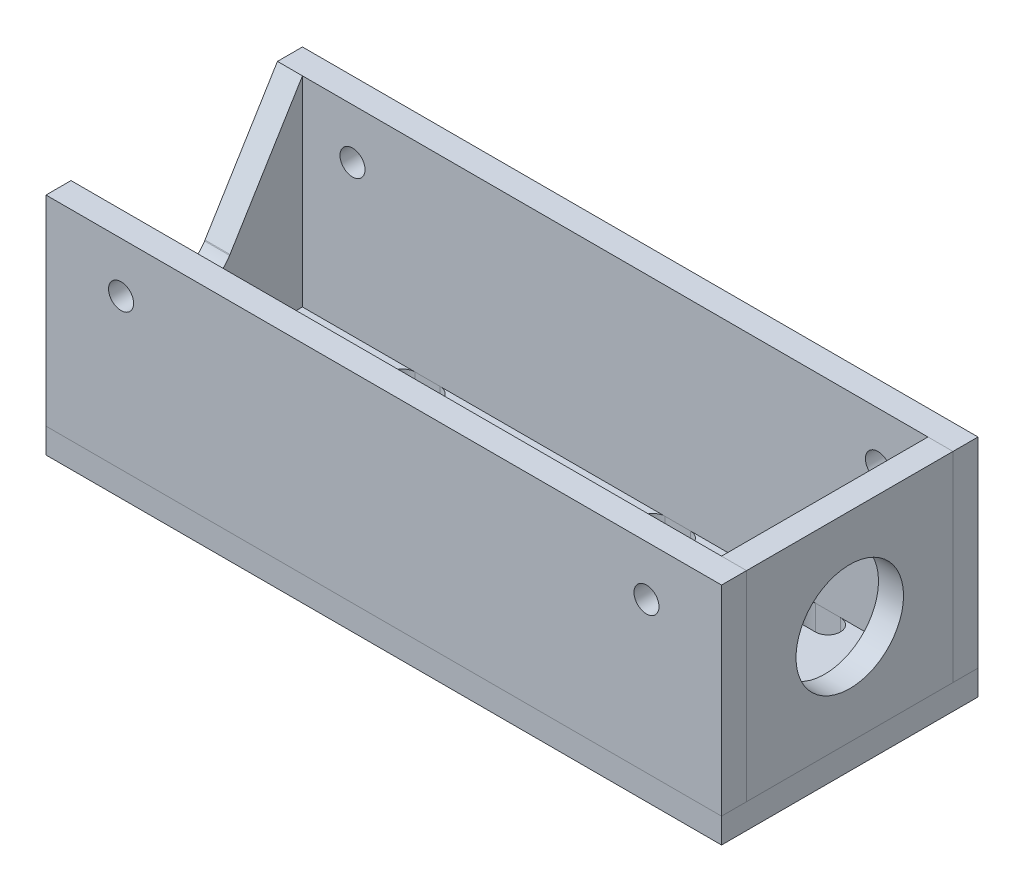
ISO-10303-21;
HEADER;
FILE_DESCRIPTION(('STEP AP214'),'2;1');
FILE_NAME('part.step','',(''),(''),'','','');
FILE_SCHEMA(('AUTOMOTIVE_DESIGN { 1 0 10303 214 1 1 1 1 }'));
ENDSEC;
DATA;
#1=APPLICATION_CONTEXT('core data for automotive mechanical design processes');
#2=APPLICATION_PROTOCOL_DEFINITION('international standard','automotive_design',2000,#1);
#3=PRODUCT_CONTEXT('',#1,'mechanical');
#4=PRODUCT('Part','Part','',(#3));
#5=PRODUCT_RELATED_PRODUCT_CATEGORY('part','',(#4));
#6=PRODUCT_DEFINITION_FORMATION('','',#4);
#7=PRODUCT_DEFINITION_CONTEXT('part definition',#1,'design');
#8=PRODUCT_DEFINITION('design','',#6,#7);
#9=PRODUCT_DEFINITION_SHAPE('','',#8);
#10=(LENGTH_UNIT() NAMED_UNIT(*) SI_UNIT(.MILLI.,.METRE.));
#11=(NAMED_UNIT(*) PLANE_ANGLE_UNIT() SI_UNIT($,.RADIAN.));
#12=(NAMED_UNIT(*) SI_UNIT($,.STERADIAN.) SOLID_ANGLE_UNIT());
#13=UNCERTAINTY_MEASURE_WITH_UNIT(LENGTH_MEASURE(1.E-05),#10,'distance_accuracy_value','');
#14=(GEOMETRIC_REPRESENTATION_CONTEXT(3) GLOBAL_UNCERTAINTY_ASSIGNED_CONTEXT((#13)) GLOBAL_UNIT_ASSIGNED_CONTEXT((#10,
#11,#12)) REPRESENTATION_CONTEXT('',''));
#15=CARTESIAN_POINT('',(0.,0.,0.));
#16=DIRECTION('',(0.,0.,1.));
#17=DIRECTION('',(1.,0.,0.));
#18=AXIS2_PLACEMENT_3D('',#15,#16,#17);
#19=CARTESIAN_POINT('',(165.1,57.15,0.));
#20=DIRECTION('',(-1.,0.,0.));
#21=DIRECTION('',(0.,0.,1.));
#22=AXIS2_PLACEMENT_3D('',#19,#20,#21);
#23=PLANE('',#22);
#24=CARTESIAN_POINT('',(165.1,31.75,-26.19375));
#25=DIRECTION('',(1.,0.,0.));
#26=DIRECTION('',(0.,0.,-1.));
#27=AXIS2_PLACEMENT_3D('',#24,#25,#26);
#28=CIRCLE('',#27,13.6435574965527);
#29=CARTESIAN_POINT('',(165.1,31.75,-39.8373074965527));
#30=VERTEX_POINT('',#29);
#31=EDGE_CURVE('E121',#30,#30,#28,.T.);
#32=ORIENTED_EDGE('',*,*,#31,.F.);
#33=EDGE_LOOP('',(#32));
#34=FACE_BOUND('',#33,.T.);
#35=DIRECTION('',(0.,0.,-1.));
#36=VECTOR('',#35,1.);
#37=CARTESIAN_POINT('',(165.1,6.35,0.));
#38=LINE('',#37,#36);
#39=CARTESIAN_POINT('',(165.1,6.35,0.));
#40=VERTEX_POINT('',#39);
#41=CARTESIAN_POINT('',(165.1,6.35,-52.3875));
#42=VERTEX_POINT('',#41);
#43=EDGE_CURVE('E107',#40,#42,#38,.T.);
#44=ORIENTED_EDGE('',*,*,#43,.T.);
#45=DIRECTION('',(0.,-1.,0.));
#46=VECTOR('',#45,1.);
#47=CARTESIAN_POINT('',(165.1,57.15,-52.3875));
#48=LINE('',#47,#46);
#49=CARTESIAN_POINT('',(165.1,57.15,-52.3875));
#50=VERTEX_POINT('',#49);
#51=EDGE_CURVE('E12',#50,#42,#48,.T.);
#52=ORIENTED_EDGE('',*,*,#51,.F.);
#53=DIRECTION('',(0.,0.,-1.));
#54=VECTOR('',#53,1.);
#55=CARTESIAN_POINT('',(165.1,57.15,0.));
#56=LINE('',#55,#54);
#57=CARTESIAN_POINT('',(165.1,57.15,0.));
#58=VERTEX_POINT('',#57);
#59=EDGE_CURVE('E95',#58,#50,#56,.T.);
#60=ORIENTED_EDGE('',*,*,#59,.F.);
#61=DIRECTION('',(0.,-1.,0.));
#62=VECTOR('',#61,1.);
#63=CARTESIAN_POINT('',(165.1,57.15,0.));
#64=LINE('',#63,#62);
#65=EDGE_CURVE('E103',#58,#40,#64,.T.);
#66=ORIENTED_EDGE('',*,*,#65,.T.);
#67=EDGE_LOOP('',(#44,#52,#60,#66));
#68=FACE_BOUND('',#67,.T.);
#69=ADVANCED_FACE('F44',(#34,#68),#23,.F.);
#70=CARTESIAN_POINT('',(165.1,57.15,-52.3875));
#71=DIRECTION('',(0.,0.,1.));
#72=DIRECTION('',(1.,0.,0.));
#73=AXIS2_PLACEMENT_3D('',#70,#71,#72);
#74=PLANE('',#73);
#75=DIRECTION('',(-1.,0.,0.));
#76=VECTOR('',#75,1.);
#77=CARTESIAN_POINT('',(165.1,6.35,-52.3875));
#78=LINE('',#77,#76);
#79=CARTESIAN_POINT('',(158.75,6.35,-52.3875));
#80=VERTEX_POINT('',#79);
#81=EDGE_CURVE('E99',#42,#80,#78,.T.);
#82=ORIENTED_EDGE('',*,*,#81,.T.);
#83=DIRECTION('',(0.,-1.,0.));
#84=VECTOR('',#83,1.);
#85=CARTESIAN_POINT('',(158.75,57.15,-52.3875));
#86=LINE('',#85,#84);
#87=CARTESIAN_POINT('',(158.75,57.15,-52.3875));
#88=VERTEX_POINT('',#87);
#89=EDGE_CURVE('E52',#88,#80,#86,.T.);
#90=ORIENTED_EDGE('',*,*,#89,.F.);
#91=DIRECTION('',(-1.,0.,0.));
#92=VECTOR('',#91,1.);
#93=CARTESIAN_POINT('',(165.1,57.15,-52.3875));
#94=LINE('',#93,#92);
#95=EDGE_CURVE('E90',#50,#88,#94,.T.);
#96=ORIENTED_EDGE('',*,*,#95,.F.);
#97=ORIENTED_EDGE('',*,*,#51,.T.);
#98=EDGE_LOOP('',(#82,#90,#96,#97));
#99=FACE_BOUND('',#98,.T.);
#100=ADVANCED_FACE('F98',(#99),#74,.F.);
#101=CARTESIAN_POINT('',(158.75,57.15,0.));
#102=DIRECTION('',(1.,0.,0.));
#103=DIRECTION('',(0.,0.,-1.));
#104=AXIS2_PLACEMENT_3D('',#101,#102,#103);
#105=PLANE('',#104);
#106=CARTESIAN_POINT('',(158.75,31.75,-26.19375));
#107=DIRECTION('',(1.,0.,0.));
#108=DIRECTION('',(0.,0.,-1.));
#109=AXIS2_PLACEMENT_3D('',#106,#107,#108);
#110=CIRCLE('',#109,13.6435574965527);
#111=CARTESIAN_POINT('',(158.75,31.75,-39.8373074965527));
#112=VERTEX_POINT('',#111);
#113=EDGE_CURVE('E110',#112,#112,#110,.T.);
#114=ORIENTED_EDGE('',*,*,#113,.T.);
#115=EDGE_LOOP('',(#114));
#116=FACE_BOUND('',#115,.T.);
#117=DIRECTION('',(0.,0.,1.));
#118=VECTOR('',#117,1.);
#119=CARTESIAN_POINT('',(158.75,6.35,0.));
#120=LINE('',#119,#118);
#121=CARTESIAN_POINT('',(158.75,6.35,0.));
#122=VERTEX_POINT('',#121);
#123=EDGE_CURVE('E77',#80,#122,#120,.T.);
#124=ORIENTED_EDGE('',*,*,#123,.T.);
#125=DIRECTION('',(0.,-1.,0.));
#126=VECTOR('',#125,1.);
#127=CARTESIAN_POINT('',(158.75,57.15,0.));
#128=LINE('',#127,#126);
#129=CARTESIAN_POINT('',(158.75,57.15,0.));
#130=VERTEX_POINT('',#129);
#131=EDGE_CURVE('E100',#130,#122,#128,.T.);
#132=ORIENTED_EDGE('',*,*,#131,.F.);
#133=DIRECTION('',(0.,0.,1.));
#134=VECTOR('',#133,1.);
#135=CARTESIAN_POINT('',(158.75,57.15,0.));
#136=LINE('',#135,#134);
#137=EDGE_CURVE('E93',#88,#130,#136,.T.);
#138=ORIENTED_EDGE('',*,*,#137,.F.);
#139=ORIENTED_EDGE('',*,*,#89,.T.);
#140=EDGE_LOOP('',(#124,#132,#138,#139));
#141=FACE_BOUND('',#140,.T.);
#142=ADVANCED_FACE('F101',(#116,#141),#105,.F.);
#143=CARTESIAN_POINT('',(165.1,57.15,0.));
#144=DIRECTION('',(0.,0.,-1.));
#145=DIRECTION('',(-1.,0.,0.));
#146=AXIS2_PLACEMENT_3D('',#143,#144,#145);
#147=PLANE('',#146);
#148=DIRECTION('',(1.,0.,0.));
#149=VECTOR('',#148,1.);
#150=CARTESIAN_POINT('',(165.1,6.35,0.));
#151=LINE('',#150,#149);
#152=EDGE_CURVE('E83',#122,#40,#151,.T.);
#153=ORIENTED_EDGE('',*,*,#152,.T.);
#154=ORIENTED_EDGE('',*,*,#65,.F.);
#155=DIRECTION('',(1.,0.,0.));
#156=VECTOR('',#155,1.);
#157=CARTESIAN_POINT('',(165.1,57.15,0.));
#158=LINE('',#157,#156);
#159=EDGE_CURVE('E60',#130,#58,#158,.T.);
#160=ORIENTED_EDGE('',*,*,#159,.F.);
#161=ORIENTED_EDGE('',*,*,#131,.T.);
#162=EDGE_LOOP('',(#153,#154,#160,#161));
#163=FACE_BOUND('',#162,.T.);
#164=ADVANCED_FACE('F115',(#163),#147,.F.);
#165=CARTESIAN_POINT('',(0.,57.15,0.));
#166=DIRECTION('',(0.,1.,0.));
#167=DIRECTION('',(0.,0.,1.));
#168=AXIS2_PLACEMENT_3D('',#165,#166,#167);
#169=PLANE('',#168);
#170=ORIENTED_EDGE('',*,*,#59,.T.);
#171=ORIENTED_EDGE('',*,*,#95,.T.);
#172=ORIENTED_EDGE('',*,*,#137,.T.);
#173=ORIENTED_EDGE('',*,*,#159,.T.);
#174=EDGE_LOOP('',(#170,#171,#172,#173));
#175=FACE_BOUND('',#174,.T.);
#176=ADVANCED_FACE('F91',(#175),#169,.T.);
#177=CARTESIAN_POINT('',(0.,6.35,0.));
#178=DIRECTION('',(0.,1.,0.));
#179=DIRECTION('',(0.,0.,1.));
#180=AXIS2_PLACEMENT_3D('',#177,#178,#179);
#181=PLANE('',#180);
#182=ORIENTED_EDGE('',*,*,#43,.F.);
#183=ORIENTED_EDGE('',*,*,#152,.F.);
#184=ORIENTED_EDGE('',*,*,#123,.F.);
#185=ORIENTED_EDGE('',*,*,#81,.F.);
#186=EDGE_LOOP('',(#182,#183,#184,#185));
#187=FACE_BOUND('',#186,.T.);
#188=ADVANCED_FACE('F118',(#187),#181,.F.);
#189=CARTESIAN_POINT('',(158.75,31.75,-26.19375));
#190=DIRECTION('',(1.,0.,0.));
#191=DIRECTION('',(0.,0.,-1.));
#192=AXIS2_PLACEMENT_3D('',#189,#190,#191);
#193=CYLINDRICAL_SURFACE('',#192,13.6435574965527);
#194=ORIENTED_EDGE('',*,*,#113,.F.);
#195=EDGE_LOOP('',(#194));
#196=FACE_BOUND('',#195,.T.);
#197=ORIENTED_EDGE('',*,*,#31,.T.);
#198=EDGE_LOOP('',(#197));
#199=FACE_BOUND('',#198,.T.);
#200=ADVANCED_FACE('F128',(#196,#199),#193,.F.);
#201=CLOSED_SHELL('',(#69,#100,#142,#164,#176,#188,#200));
#202=MANIFOLD_SOLID_BREP('B2',#201);
#203=CARTESIAN_POINT('',(0.,31.75,-26.19375));
#204=DIRECTION('',(-1.,0.,0.));
#205=DIRECTION('',(0.,0.,1.));
#206=AXIS2_PLACEMENT_3D('',#203,#204,#205);
#207=CYLINDRICAL_SURFACE('',#206,9.09570499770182);
#208=CARTESIAN_POINT('',(0.,31.75,-26.19375));
#209=DIRECTION('',(-1.,0.,0.));
#210=DIRECTION('',(0.,0.,1.));
#211=AXIS2_PLACEMENT_3D('',#208,#209,#210);
#212=CIRCLE('',#211,9.09570499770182);
#213=CARTESIAN_POINT('',(0.,27.0868551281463,-34.0031628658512));
#214=VERTEX_POINT('',#213);
#215=CARTESIAN_POINT('',(0.,26.9230963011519,-33.9030203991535));
#216=VERTEX_POINT('',#215);
#217=EDGE_CURVE('E284',#214,#216,#212,.T.);
#218=ORIENTED_EDGE('',*,*,#217,.F.);
#219=DIRECTION('',(-1.,0.,0.));
#220=VECTOR('',#219,1.);
#221=CARTESIAN_POINT('',(0.,27.0868551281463,-34.0031628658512));
#222=LINE('',#221,#220);
#223=CARTESIAN_POINT('',(-6.35,27.0868551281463,-34.0031628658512));
#224=VERTEX_POINT('',#223);
#225=EDGE_CURVE('E42',#214,#224,#222,.T.);
#226=ORIENTED_EDGE('',*,*,#225,.T.);
#227=CARTESIAN_POINT('',(-6.35,31.75,-26.19375));
#228=DIRECTION('',(-1.,0.,0.));
#229=DIRECTION('',(0.,0.,1.));
#230=AXIS2_PLACEMENT_3D('',#227,#228,#229);
#231=CIRCLE('',#230,9.09570499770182);
#232=CARTESIAN_POINT('',(-6.35,26.9230963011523,-33.9030203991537));
#233=VERTEX_POINT('',#232);
#234=EDGE_CURVE('E288',#224,#233,#231,.T.);
#235=ORIENTED_EDGE('',*,*,#234,.T.);
#236=DIRECTION('',(-1.,0.,0.));
#237=VECTOR('',#236,1.);
#238=CARTESIAN_POINT('',(0.,26.9230963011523,-33.9030203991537));
#239=LINE('',#238,#237);
#240=EDGE_CURVE('E274',#216,#233,#239,.T.);
#241=ORIENTED_EDGE('',*,*,#240,.F.);
#242=EDGE_LOOP('',(#218,#226,#235,#241));
#243=FACE_BOUND('',#242,.T.);
#244=ADVANCED_FACE('F199',(#243),#207,.F.);
#245=CARTESIAN_POINT('',(-6.35,57.15,-52.3875));
#246=DIRECTION('',(1.,0.,0.));
#247=DIRECTION('',(0.,0.,-1.));
#248=AXIS2_PLACEMENT_3D('',#245,#246,#247);
#249=PLANE('',#248);
#250=ORIENTED_EDGE('',*,*,#234,.F.);
#251=DIRECTION('',(0.,-0.853125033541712,0.521706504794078));
#252=VECTOR('',#251,1.);
#253=CARTESIAN_POINT('',(-6.35,26.9230963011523,-33.9030203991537));
#254=LINE('',#253,#252);
#255=CARTESIAN_POINT('',(-6.35,57.15,-52.3875));
#256=VERTEX_POINT('',#255);
#257=EDGE_CURVE('E214',#256,#224,#254,.T.);
#258=ORIENTED_EDGE('',*,*,#257,.F.);
#259=DIRECTION('',(0.,-1.,0.));
#260=VECTOR('',#259,1.);
#261=CARTESIAN_POINT('',(-6.35,57.15,-52.3875));
#262=LINE('',#261,#260);
#263=CARTESIAN_POINT('',(-6.35,6.35,-52.3875));
#264=VERTEX_POINT('',#263);
#265=EDGE_CURVE('E300',#256,#264,#262,.T.);
#266=ORIENTED_EDGE('',*,*,#265,.T.);
#267=DIRECTION('',(0.,0.,1.));
#268=VECTOR('',#267,1.);
#269=CARTESIAN_POINT('',(-6.35,6.35,-52.3875));
#270=LINE('',#269,#268);
#271=CARTESIAN_POINT('',(-6.35,6.35,0.));
#272=VERTEX_POINT('',#271);
#273=EDGE_CURVE('E290',#264,#272,#270,.T.);
#274=ORIENTED_EDGE('',*,*,#273,.T.);
#275=DIRECTION('',(0.,-1.,0.));
#276=VECTOR('',#275,1.);
#277=CARTESIAN_POINT('',(-6.35,57.15,0.));
#278=LINE('',#277,#276);
#279=CARTESIAN_POINT('',(-6.35,57.15,0.));
#280=VERTEX_POINT('',#279);
#281=EDGE_CURVE('E316',#280,#272,#278,.T.);
#282=ORIENTED_EDGE('',*,*,#281,.F.);
#283=DIRECTION('',(0.,0.853058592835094,0.521815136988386));
#284=VECTOR('',#283,1.);
#285=CARTESIAN_POINT('',(-6.35,26.7489430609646,-18.596297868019));
#286=LINE('',#285,#284);
#287=CARTESIAN_POINT('',(-6.35,27.2637282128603,-18.2814042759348));
#288=VERTEX_POINT('',#287);
#289=EDGE_CURVE('E337',#288,#280,#286,.T.);
#290=ORIENTED_EDGE('',*,*,#289,.F.);
#291=CARTESIAN_POINT('',(-6.35,26.7489430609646,-18.596297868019));
#292=VERTEX_POINT('',#291);
#293=EDGE_CURVE('E273',#292,#288,#231,.T.);
#294=ORIENTED_EDGE('',*,*,#293,.F.);
#295=CARTESIAN_POINT('',(-6.35,31.6367126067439,-26.1950389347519));
#296=DIRECTION('',(-1.,0.,0.));
#297=DIRECTION('',(0.,0.,1.));
#298=AXIS2_PLACEMENT_3D('',#295,#296,#297);
#299=CIRCLE('',#298,9.0349962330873);
#300=EDGE_CURVE('E268',#233,#292,#299,.T.);
#301=ORIENTED_EDGE('',*,*,#300,.F.);
#302=EDGE_LOOP('',(#250,#258,#266,#274,#282,#290,#294,#301));
#303=FACE_BOUND('',#302,.T.);
#304=ADVANCED_FACE('F201',(#303),#249,.F.);
#305=CARTESIAN_POINT('',(-6.35,57.15,0.));
#306=DIRECTION('',(0.,0.,-1.));
#307=DIRECTION('',(-1.,0.,0.));
#308=AXIS2_PLACEMENT_3D('',#305,#306,#307);
#309=PLANE('',#308);
#310=DIRECTION('',(1.,0.,0.));
#311=VECTOR('',#310,1.);
#312=CARTESIAN_POINT('',(-6.35,6.35,0.));
#313=LINE('',#312,#311);
#314=CARTESIAN_POINT('',(0.,6.35,0.));
#315=VERTEX_POINT('',#314);
#316=EDGE_CURVE('E303',#272,#315,#313,.T.);
#317=ORIENTED_EDGE('',*,*,#316,.T.);
#318=DIRECTION('',(0.,-1.,0.));
#319=VECTOR('',#318,1.);
#320=CARTESIAN_POINT('',(0.,57.15,0.));
#321=LINE('',#320,#319);
#322=CARTESIAN_POINT('',(0.,57.15,0.));
#323=VERTEX_POINT('',#322);
#324=EDGE_CURVE('E313',#323,#315,#321,.T.);
#325=ORIENTED_EDGE('',*,*,#324,.F.);
#326=DIRECTION('',(1.,0.,0.));
#327=VECTOR('',#326,1.);
#328=CARTESIAN_POINT('',(-6.35,57.15,0.));
#329=LINE('',#328,#327);
#330=EDGE_CURVE('E295',#280,#323,#329,.T.);
#331=ORIENTED_EDGE('',*,*,#330,.F.);
#332=ORIENTED_EDGE('',*,*,#281,.T.);
#333=EDGE_LOOP('',(#317,#325,#331,#332));
#334=FACE_BOUND('',#333,.T.);
#335=ADVANCED_FACE('F321',(#334),#309,.F.);
#336=CARTESIAN_POINT('',(0.,57.15,-52.3875));
#337=DIRECTION('',(-1.,0.,0.));
#338=DIRECTION('',(0.,0.,1.));
#339=AXIS2_PLACEMENT_3D('',#336,#337,#338);
#340=PLANE('',#339);
#341=DIRECTION('',(0.,-1.,0.));
#342=VECTOR('',#341,1.);
#343=CARTESIAN_POINT('',(0.,57.15,-52.3875));
#344=LINE('',#343,#342);
#345=CARTESIAN_POINT('',(0.,57.15,-52.3875));
#346=VERTEX_POINT('',#345);
#347=CARTESIAN_POINT('',(0.,6.35,-52.3875));
#348=VERTEX_POINT('',#347);
#349=EDGE_CURVE('E310',#346,#348,#344,.T.);
#350=ORIENTED_EDGE('',*,*,#349,.F.);
#351=DIRECTION('',(0.,-0.853125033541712,0.521706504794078));
#352=VECTOR('',#351,1.);
#353=CARTESIAN_POINT('',(0.,26.9230963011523,-33.9030203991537));
#354=LINE('',#353,#352);
#355=EDGE_CURVE('E285',#346,#214,#354,.T.);
#356=ORIENTED_EDGE('',*,*,#355,.T.);
#357=ORIENTED_EDGE('',*,*,#217,.T.);
#358=CARTESIAN_POINT('',(0.,31.6367126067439,-26.1950389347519));
#359=DIRECTION('',(-1.,0.,0.));
#360=DIRECTION('',(0.,0.,1.));
#361=AXIS2_PLACEMENT_3D('',#358,#359,#360);
#362=CIRCLE('',#361,9.0349962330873);
#363=CARTESIAN_POINT('',(0.,26.7489430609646,-18.596297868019));
#364=VERTEX_POINT('',#363);
#365=EDGE_CURVE('E265',#216,#364,#362,.T.);
#366=ORIENTED_EDGE('',*,*,#365,.T.);
#367=CARTESIAN_POINT('',(0.,27.2637282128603,-18.2814042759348));
#368=VERTEX_POINT('',#367);
#369=EDGE_CURVE('E281',#364,#368,#212,.T.);
#370=ORIENTED_EDGE('',*,*,#369,.T.);
#371=DIRECTION('',(0.,0.853058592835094,0.521815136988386));
#372=VECTOR('',#371,1.);
#373=CARTESIAN_POINT('',(0.,26.7489430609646,-18.596297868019));
#374=LINE('',#373,#372);
#375=EDGE_CURVE('E221',#368,#323,#374,.T.);
#376=ORIENTED_EDGE('',*,*,#375,.T.);
#377=ORIENTED_EDGE('',*,*,#324,.T.);
#378=DIRECTION('',(0.,0.,-1.));
#379=VECTOR('',#378,1.);
#380=CARTESIAN_POINT('',(0.,6.35,-52.3875));
#381=LINE('',#380,#379);
#382=EDGE_CURVE('E305',#315,#348,#381,.T.);
#383=ORIENTED_EDGE('',*,*,#382,.T.);
#384=EDGE_LOOP('',(#350,#356,#357,#366,#370,#376,#377,#383));
#385=FACE_BOUND('',#384,.T.);
#386=ADVANCED_FACE('F280',(#385),#340,.F.);
#387=CARTESIAN_POINT('',(-6.35,57.15,-52.3875));
#388=DIRECTION('',(0.,0.,1.));
#389=DIRECTION('',(1.,0.,0.));
#390=AXIS2_PLACEMENT_3D('',#387,#388,#389);
#391=PLANE('',#390);
#392=DIRECTION('',(-1.,0.,0.));
#393=VECTOR('',#392,1.);
#394=CARTESIAN_POINT('',(-6.35,6.35,-52.3875));
#395=LINE('',#394,#393);
#396=EDGE_CURVE('E298',#348,#264,#395,.T.);
#397=ORIENTED_EDGE('',*,*,#396,.T.);
#398=ORIENTED_EDGE('',*,*,#265,.F.);
#399=DIRECTION('',(-1.,0.,0.));
#400=VECTOR('',#399,1.);
#401=CARTESIAN_POINT('',(-6.35,57.15,-52.3875));
#402=LINE('',#401,#400);
#403=EDGE_CURVE('E297',#346,#256,#402,.T.);
#404=ORIENTED_EDGE('',*,*,#403,.F.);
#405=ORIENTED_EDGE('',*,*,#349,.T.);
#406=EDGE_LOOP('',(#397,#398,#404,#405));
#407=FACE_BOUND('',#406,.T.);
#408=ADVANCED_FACE('F334',(#407),#391,.F.);
#409=CARTESIAN_POINT('',(0.,6.35,0.));
#410=DIRECTION('',(0.,1.,0.));
#411=DIRECTION('',(0.,0.,1.));
#412=AXIS2_PLACEMENT_3D('',#409,#410,#411);
#413=PLANE('',#412);
#414=ORIENTED_EDGE('',*,*,#273,.F.);
#415=ORIENTED_EDGE('',*,*,#396,.F.);
#416=ORIENTED_EDGE('',*,*,#382,.F.);
#417=ORIENTED_EDGE('',*,*,#316,.F.);
#418=EDGE_LOOP('',(#414,#415,#416,#417));
#419=FACE_BOUND('',#418,.T.);
#420=ADVANCED_FACE('F330',(#419),#413,.F.);
#421=ORIENTED_EDGE('',*,*,#293,.T.);
#422=DIRECTION('',(-1.,0.,0.));
#423=VECTOR('',#422,1.);
#424=CARTESIAN_POINT('',(0.,27.2637282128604,-18.2814042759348));
#425=LINE('',#424,#423);
#426=EDGE_CURVE('E207',#288,#368,#425,.F.);
#427=ORIENTED_EDGE('',*,*,#426,.T.);
#428=ORIENTED_EDGE('',*,*,#369,.F.);
#429=DIRECTION('',(-1.,0.,0.));
#430=VECTOR('',#429,1.);
#431=CARTESIAN_POINT('',(0.,26.7489430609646,-18.596297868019));
#432=LINE('',#431,#430);
#433=EDGE_CURVE('E262',#364,#292,#432,.T.);
#434=ORIENTED_EDGE('',*,*,#433,.T.);
#435=EDGE_LOOP('',(#421,#427,#428,#434));
#436=FACE_BOUND('',#435,.T.);
#437=ADVANCED_FACE('F287',(#436),#207,.F.);
#438=CARTESIAN_POINT('',(0.,31.6367126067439,-26.1950389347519));
#439=DIRECTION('',(-1.,0.,0.));
#440=DIRECTION('',(0.,0.,1.));
#441=AXIS2_PLACEMENT_3D('',#438,#439,#440);
#442=CYLINDRICAL_SURFACE('',#441,9.0349962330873);
#443=ORIENTED_EDGE('',*,*,#300,.T.);
#444=ORIENTED_EDGE('',*,*,#433,.F.);
#445=ORIENTED_EDGE('',*,*,#365,.F.);
#446=ORIENTED_EDGE('',*,*,#240,.T.);
#447=EDGE_LOOP('',(#443,#444,#445,#446));
#448=FACE_BOUND('',#447,.T.);
#449=ADVANCED_FACE('F264',(#448),#442,.F.);
#450=CARTESIAN_POINT('',(0.,26.7489430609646,-18.596297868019));
#451=DIRECTION('',(0.,-0.521815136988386,0.853058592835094));
#452=DIRECTION('',(0.,-0.853058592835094,-0.521815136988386));
#453=AXIS2_PLACEMENT_3D('',#450,#451,#452);
#454=PLANE('',#453);
#455=ORIENTED_EDGE('',*,*,#289,.T.);
#456=ORIENTED_EDGE('',*,*,#330,.T.);
#457=ORIENTED_EDGE('',*,*,#375,.F.);
#458=ORIENTED_EDGE('',*,*,#426,.F.);
#459=EDGE_LOOP('',(#455,#456,#457,#458));
#460=FACE_BOUND('',#459,.T.);
#461=ADVANCED_FACE('F355',(#460),#454,.F.);
#462=CARTESIAN_POINT('',(0.,26.9230963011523,-33.9030203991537));
#463=DIRECTION('',(0.,-0.521706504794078,-0.853125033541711));
#464=DIRECTION('',(0.,0.853125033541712,-0.521706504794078));
#465=AXIS2_PLACEMENT_3D('',#462,#463,#464);
#466=PLANE('',#465);
#467=ORIENTED_EDGE('',*,*,#355,.F.);
#468=ORIENTED_EDGE('',*,*,#403,.T.);
#469=ORIENTED_EDGE('',*,*,#257,.T.);
#470=ORIENTED_EDGE('',*,*,#225,.F.);
#471=EDGE_LOOP('',(#467,#468,#469,#470));
#472=FACE_BOUND('',#471,.T.);
#473=ADVANCED_FACE('F335',(#472),#466,.F.);
#474=CLOSED_SHELL('',(#244,#304,#335,#386,#408,#420,#437,#449,#461,#473));
#475=MANIFOLD_SOLID_BREP('B6',#474);
#476=CARTESIAN_POINT('',(165.1,57.15,6.35));
#477=DIRECTION('',(-1.,0.,0.));
#478=DIRECTION('',(0.,0.,1.));
#479=AXIS2_PLACEMENT_3D('',#476,#477,#478);
#480=PLANE('',#479);
#481=DIRECTION('',(0.,0.,-1.));
#482=VECTOR('',#481,1.);
#483=CARTESIAN_POINT('',(165.1,6.35,6.35));
#484=LINE('',#483,#482);
#485=CARTESIAN_POINT('',(165.1,6.35,6.35));
#486=VERTEX_POINT('',#485);
#487=CARTESIAN_POINT('',(165.1,6.35,0.));
#488=VERTEX_POINT('',#487);
#489=EDGE_CURVE('E497',#486,#488,#484,.T.);
#490=ORIENTED_EDGE('',*,*,#489,.T.);
#491=DIRECTION('',(0.,-1.,0.));
#492=VECTOR('',#491,1.);
#493=CARTESIAN_POINT('',(165.1,57.15,0.));
#494=LINE('',#493,#492);
#495=CARTESIAN_POINT('',(165.1,57.15,0.));
#496=VERTEX_POINT('',#495);
#497=EDGE_CURVE('E197',#496,#488,#494,.T.);
#498=ORIENTED_EDGE('',*,*,#497,.F.);
#499=DIRECTION('',(0.,0.,-1.));
#500=VECTOR('',#499,1.);
#501=CARTESIAN_POINT('',(165.1,57.15,6.35));
#502=LINE('',#501,#500);
#503=CARTESIAN_POINT('',(165.1,57.15,6.35));
#504=VERTEX_POINT('',#503);
#505=EDGE_CURVE('E485',#504,#496,#502,.T.);
#506=ORIENTED_EDGE('',*,*,#505,.F.);
#507=DIRECTION('',(0.,-1.,0.));
#508=VECTOR('',#507,1.);
#509=CARTESIAN_POINT('',(165.1,57.15,6.35));
#510=LINE('',#509,#508);
#511=EDGE_CURVE('E493',#504,#486,#510,.T.);
#512=ORIENTED_EDGE('',*,*,#511,.T.);
#513=EDGE_LOOP('',(#490,#498,#506,#512));
#514=FACE_BOUND('',#513,.T.);
#515=ADVANCED_FACE('F434',(#514),#480,.F.);
#516=CARTESIAN_POINT('',(165.1,57.15,0.));
#517=DIRECTION('',(0.,0.,1.));
#518=DIRECTION('',(1.,0.,0.));
#519=AXIS2_PLACEMENT_3D('',#516,#517,#518);
#520=PLANE('',#519);
#521=CARTESIAN_POINT('',(146.05,44.45,0.));
#522=DIRECTION('',(0.,0.,1.));
#523=DIRECTION('',(1.,0.,0.));
#524=AXIS2_PLACEMENT_3D('',#521,#522,#523);
#525=CIRCLE('',#524,3.175);
#526=CARTESIAN_POINT('',(149.225,44.45,0.));
#527=VERTEX_POINT('',#526);
#528=EDGE_CURVE('E514',#527,#527,#525,.T.);
#529=ORIENTED_EDGE('',*,*,#528,.T.);
#530=EDGE_LOOP('',(#529));
#531=FACE_BOUND('',#530,.T.);
#532=CARTESIAN_POINT('',(12.7,44.45,0.));
#533=DIRECTION('',(0.,0.,1.));
#534=DIRECTION('',(1.,0.,0.));
#535=AXIS2_PLACEMENT_3D('',#532,#533,#534);
#536=CIRCLE('',#535,3.175);
#537=CARTESIAN_POINT('',(15.875,44.45,0.));
#538=VERTEX_POINT('',#537);
#539=EDGE_CURVE('E500',#538,#538,#536,.T.);
#540=ORIENTED_EDGE('',*,*,#539,.T.);
#541=EDGE_LOOP('',(#540));
#542=FACE_BOUND('',#541,.T.);
#543=DIRECTION('',(-1.,0.,0.));
#544=VECTOR('',#543,1.);
#545=CARTESIAN_POINT('',(165.1,6.35,0.));
#546=LINE('',#545,#544);
#547=CARTESIAN_POINT('',(-6.35,6.35,0.));
#548=VERTEX_POINT('',#547);
#549=EDGE_CURVE('E489',#488,#548,#546,.T.);
#550=ORIENTED_EDGE('',*,*,#549,.T.);
#551=DIRECTION('',(0.,-1.,0.));
#552=VECTOR('',#551,1.);
#553=CARTESIAN_POINT('',(-6.35,57.15,0.));
#554=LINE('',#553,#552);
#555=CARTESIAN_POINT('',(-6.35,57.15,0.));
#556=VERTEX_POINT('',#555);
#557=EDGE_CURVE('E442',#556,#548,#554,.T.);
#558=ORIENTED_EDGE('',*,*,#557,.F.);
#559=DIRECTION('',(-1.,0.,0.));
#560=VECTOR('',#559,1.);
#561=CARTESIAN_POINT('',(165.1,57.15,0.));
#562=LINE('',#561,#560);
#563=EDGE_CURVE('E480',#496,#556,#562,.T.);
#564=ORIENTED_EDGE('',*,*,#563,.F.);
#565=ORIENTED_EDGE('',*,*,#497,.T.);
#566=EDGE_LOOP('',(#550,#558,#564,#565));
#567=FACE_BOUND('',#566,.T.);
#568=ADVANCED_FACE('F488',(#531,#542,#567),#520,.F.);
#569=CARTESIAN_POINT('',(-6.35,57.15,6.35));
#570=DIRECTION('',(1.,0.,0.));
#571=DIRECTION('',(0.,0.,-1.));
#572=AXIS2_PLACEMENT_3D('',#569,#570,#571);
#573=PLANE('',#572);
#574=DIRECTION('',(0.,0.,1.));
#575=VECTOR('',#574,1.);
#576=CARTESIAN_POINT('',(-6.35,6.35,6.35));
#577=LINE('',#576,#575);
#578=CARTESIAN_POINT('',(-6.35,6.35,6.35));
#579=VERTEX_POINT('',#578);
#580=EDGE_CURVE('E467',#548,#579,#577,.T.);
#581=ORIENTED_EDGE('',*,*,#580,.T.);
#582=DIRECTION('',(0.,-1.,0.));
#583=VECTOR('',#582,1.);
#584=CARTESIAN_POINT('',(-6.35,57.15,6.35));
#585=LINE('',#584,#583);
#586=CARTESIAN_POINT('',(-6.35,57.15,6.35));
#587=VERTEX_POINT('',#586);
#588=EDGE_CURVE('E490',#587,#579,#585,.T.);
#589=ORIENTED_EDGE('',*,*,#588,.F.);
#590=DIRECTION('',(0.,0.,1.));
#591=VECTOR('',#590,1.);
#592=CARTESIAN_POINT('',(-6.35,57.15,6.35));
#593=LINE('',#592,#591);
#594=EDGE_CURVE('E483',#556,#587,#593,.T.);
#595=ORIENTED_EDGE('',*,*,#594,.F.);
#596=ORIENTED_EDGE('',*,*,#557,.T.);
#597=EDGE_LOOP('',(#581,#589,#595,#596));
#598=FACE_BOUND('',#597,.T.);
#599=ADVANCED_FACE('F491',(#598),#573,.F.);
#600=CARTESIAN_POINT('',(165.1,57.15,6.35));
#601=DIRECTION('',(0.,0.,-1.));
#602=DIRECTION('',(-1.,0.,0.));
#603=AXIS2_PLACEMENT_3D('',#600,#601,#602);
#604=PLANE('',#603);
#605=CARTESIAN_POINT('',(146.05,44.45,6.35));
#606=DIRECTION('',(0.,0.,1.));
#607=DIRECTION('',(1.,0.,0.));
#608=AXIS2_PLACEMENT_3D('',#605,#606,#607);
#609=CIRCLE('',#608,3.175);
#610=CARTESIAN_POINT('',(149.225,44.45,6.35));
#611=VERTEX_POINT('',#610);
#612=EDGE_CURVE('E517',#611,#611,#609,.T.);
#613=ORIENTED_EDGE('',*,*,#612,.F.);
#614=EDGE_LOOP('',(#613));
#615=FACE_BOUND('',#614,.T.);
#616=CARTESIAN_POINT('',(12.7,44.45,6.35));
#617=DIRECTION('',(0.,0.,1.));
#618=DIRECTION('',(1.,0.,0.));
#619=AXIS2_PLACEMENT_3D('',#616,#617,#618);
#620=CIRCLE('',#619,3.175);
#621=CARTESIAN_POINT('',(15.875,44.45,6.35));
#622=VERTEX_POINT('',#621);
#623=EDGE_CURVE('E511',#622,#622,#620,.T.);
#624=ORIENTED_EDGE('',*,*,#623,.F.);
#625=EDGE_LOOP('',(#624));
#626=FACE_BOUND('',#625,.T.);
#627=DIRECTION('',(1.,0.,0.));
#628=VECTOR('',#627,1.);
#629=CARTESIAN_POINT('',(165.1,6.35,6.35));
#630=LINE('',#629,#628);
#631=EDGE_CURVE('E473',#579,#486,#630,.T.);
#632=ORIENTED_EDGE('',*,*,#631,.T.);
#633=ORIENTED_EDGE('',*,*,#511,.F.);
#634=DIRECTION('',(1.,0.,0.));
#635=VECTOR('',#634,1.);
#636=CARTESIAN_POINT('',(165.1,57.15,6.35));
#637=LINE('',#636,#635);
#638=EDGE_CURVE('E450',#587,#504,#637,.T.);
#639=ORIENTED_EDGE('',*,*,#638,.F.);
#640=ORIENTED_EDGE('',*,*,#588,.T.);
#641=EDGE_LOOP('',(#632,#633,#639,#640));
#642=FACE_BOUND('',#641,.T.);
#643=ADVANCED_FACE('F505',(#615,#626,#642),#604,.F.);
#644=CARTESIAN_POINT('',(0.,57.15,0.));
#645=DIRECTION('',(0.,1.,0.));
#646=DIRECTION('',(0.,0.,1.));
#647=AXIS2_PLACEMENT_3D('',#644,#645,#646);
#648=PLANE('',#647);
#649=ORIENTED_EDGE('',*,*,#505,.T.);
#650=ORIENTED_EDGE('',*,*,#563,.T.);
#651=ORIENTED_EDGE('',*,*,#594,.T.);
#652=ORIENTED_EDGE('',*,*,#638,.T.);
#653=EDGE_LOOP('',(#649,#650,#651,#652));
#654=FACE_BOUND('',#653,.T.);
#655=ADVANCED_FACE('F481',(#654),#648,.T.);
#656=CARTESIAN_POINT('',(0.,6.35,0.));
#657=DIRECTION('',(0.,1.,0.));
#658=DIRECTION('',(0.,0.,1.));
#659=AXIS2_PLACEMENT_3D('',#656,#657,#658);
#660=PLANE('',#659);
#661=ORIENTED_EDGE('',*,*,#489,.F.);
#662=ORIENTED_EDGE('',*,*,#631,.F.);
#663=ORIENTED_EDGE('',*,*,#580,.F.);
#664=ORIENTED_EDGE('',*,*,#549,.F.);
#665=EDGE_LOOP('',(#661,#662,#663,#664));
#666=FACE_BOUND('',#665,.T.);
#667=ADVANCED_FACE('F508',(#666),#660,.F.);
#668=CARTESIAN_POINT('',(12.7,44.45,0.));
#669=DIRECTION('',(0.,0.,1.));
#670=DIRECTION('',(1.,0.,0.));
#671=AXIS2_PLACEMENT_3D('',#668,#669,#670);
#672=CYLINDRICAL_SURFACE('',#671,3.175);
#673=ORIENTED_EDGE('',*,*,#539,.F.);
#674=EDGE_LOOP('',(#673));
#675=FACE_BOUND('',#674,.T.);
#676=ORIENTED_EDGE('',*,*,#623,.T.);
#677=EDGE_LOOP('',(#676));
#678=FACE_BOUND('',#677,.T.);
#679=ADVANCED_FACE('F528',(#675,#678),#672,.F.);
#680=CARTESIAN_POINT('',(146.05,44.45,0.));
#681=DIRECTION('',(0.,0.,1.));
#682=DIRECTION('',(1.,0.,0.));
#683=AXIS2_PLACEMENT_3D('',#680,#681,#682);
#684=CYLINDRICAL_SURFACE('',#683,3.175);
#685=ORIENTED_EDGE('',*,*,#528,.F.);
#686=EDGE_LOOP('',(#685));
#687=FACE_BOUND('',#686,.T.);
#688=ORIENTED_EDGE('',*,*,#612,.T.);
#689=EDGE_LOOP('',(#688));
#690=FACE_BOUND('',#689,.T.);
#691=ADVANCED_FACE('F525',(#687,#690),#684,.F.);
#692=CLOSED_SHELL('',(#515,#568,#599,#643,#655,#667,#679,#691));
#693=MANIFOLD_SOLID_BREP('B36',#692);
#694=CARTESIAN_POINT('',(-6.35,57.15,-58.7375));
#695=DIRECTION('',(1.,0.,0.));
#696=DIRECTION('',(0.,0.,-1.));
#697=AXIS2_PLACEMENT_3D('',#694,#695,#696);
#698=PLANE('',#697);
#699=DIRECTION('',(0.,0.,1.));
#700=VECTOR('',#699,1.);
#701=CARTESIAN_POINT('',(-6.35,6.35,-58.7375));
#702=LINE('',#701,#700);
#703=CARTESIAN_POINT('',(-6.35,6.35,-58.7375));
#704=VERTEX_POINT('',#703);
#705=CARTESIAN_POINT('',(-6.35,6.35,-52.3875));
#706=VERTEX_POINT('',#705);
#707=EDGE_CURVE('E666',#704,#706,#702,.T.);
#708=ORIENTED_EDGE('',*,*,#707,.T.);
#709=DIRECTION('',(0.,-1.,0.));
#710=VECTOR('',#709,1.);
#711=CARTESIAN_POINT('',(-6.35,57.15,-52.3875));
#712=LINE('',#711,#710);
#713=CARTESIAN_POINT('',(-6.35,57.15,-52.3875));
#714=VERTEX_POINT('',#713);
#715=EDGE_CURVE('E432',#714,#706,#712,.T.);
#716=ORIENTED_EDGE('',*,*,#715,.F.);
#717=DIRECTION('',(0.,0.,1.));
#718=VECTOR('',#717,1.);
#719=CARTESIAN_POINT('',(-6.35,57.15,-58.7375));
#720=LINE('',#719,#718);
#721=CARTESIAN_POINT('',(-6.35,57.15,-58.7375));
#722=VERTEX_POINT('',#721);
#723=EDGE_CURVE('E654',#722,#714,#720,.T.);
#724=ORIENTED_EDGE('',*,*,#723,.F.);
#725=DIRECTION('',(0.,-1.,0.));
#726=VECTOR('',#725,1.);
#727=CARTESIAN_POINT('',(-6.35,57.15,-58.7375));
#728=LINE('',#727,#726);
#729=EDGE_CURVE('E662',#722,#704,#728,.T.);
#730=ORIENTED_EDGE('',*,*,#729,.T.);
#731=EDGE_LOOP('',(#708,#716,#724,#730));
#732=FACE_BOUND('',#731,.T.);
#733=ADVANCED_FACE('F603',(#732),#698,.F.);
#734=CARTESIAN_POINT('',(-6.35,57.15,-52.3875));
#735=DIRECTION('',(0.,0.,-1.));
#736=DIRECTION('',(-1.,0.,0.));
#737=AXIS2_PLACEMENT_3D('',#734,#735,#736);
#738=PLANE('',#737);
#739=CARTESIAN_POINT('',(146.05,44.45,-52.3875));
#740=DIRECTION('',(0.,0.,-1.));
#741=DIRECTION('',(-1.,0.,0.));
#742=AXIS2_PLACEMENT_3D('',#739,#740,#741);
#743=CIRCLE('',#742,3.175);
#744=CARTESIAN_POINT('',(142.875,44.45,-52.3875));
#745=VERTEX_POINT('',#744);
#746=EDGE_CURVE('E683',#745,#745,#743,.T.);
#747=ORIENTED_EDGE('',*,*,#746,.T.);
#748=EDGE_LOOP('',(#747));
#749=FACE_BOUND('',#748,.T.);
#750=CARTESIAN_POINT('',(12.7,44.45,-52.3875));
#751=DIRECTION('',(0.,0.,-1.));
#752=DIRECTION('',(-1.,0.,0.));
#753=AXIS2_PLACEMENT_3D('',#750,#751,#752);
#754=CIRCLE('',#753,3.175);
#755=CARTESIAN_POINT('',(9.525,44.45,-52.3875));
#756=VERTEX_POINT('',#755);
#757=EDGE_CURVE('E669',#756,#756,#754,.T.);
#758=ORIENTED_EDGE('',*,*,#757,.T.);
#759=EDGE_LOOP('',(#758));
#760=FACE_BOUND('',#759,.T.);
#761=DIRECTION('',(1.,0.,0.));
#762=VECTOR('',#761,1.);
#763=CARTESIAN_POINT('',(-6.35,6.35,-52.3875));
#764=LINE('',#763,#762);
#765=CARTESIAN_POINT('',(165.1,6.35,-52.3875));
#766=VERTEX_POINT('',#765);
#767=EDGE_CURVE('E658',#706,#766,#764,.T.);
#768=ORIENTED_EDGE('',*,*,#767,.T.);
#769=DIRECTION('',(0.,-1.,0.));
#770=VECTOR('',#769,1.);
#771=CARTESIAN_POINT('',(165.1,57.15,-52.3875));
#772=LINE('',#771,#770);
#773=CARTESIAN_POINT('',(165.1,57.15,-52.3875));
#774=VERTEX_POINT('',#773);
#775=EDGE_CURVE('E611',#774,#766,#772,.T.);
#776=ORIENTED_EDGE('',*,*,#775,.F.);
#777=DIRECTION('',(1.,0.,0.));
#778=VECTOR('',#777,1.);
#779=CARTESIAN_POINT('',(-6.35,57.15,-52.3875));
#780=LINE('',#779,#778);
#781=EDGE_CURVE('E649',#714,#774,#780,.T.);
#782=ORIENTED_EDGE('',*,*,#781,.F.);
#783=ORIENTED_EDGE('',*,*,#715,.T.);
#784=EDGE_LOOP('',(#768,#776,#782,#783));
#785=FACE_BOUND('',#784,.T.);
#786=ADVANCED_FACE('F657',(#749,#760,#785),#738,.F.);
#787=CARTESIAN_POINT('',(165.1,57.15,-58.7375));
#788=DIRECTION('',(-1.,0.,0.));
#789=DIRECTION('',(0.,0.,1.));
#790=AXIS2_PLACEMENT_3D('',#787,#788,#789);
#791=PLANE('',#790);
#792=DIRECTION('',(0.,0.,-1.));
#793=VECTOR('',#792,1.);
#794=CARTESIAN_POINT('',(165.1,6.35,-58.7375));
#795=LINE('',#794,#793);
#796=CARTESIAN_POINT('',(165.1,6.35,-58.7375));
#797=VERTEX_POINT('',#796);
#798=EDGE_CURVE('E636',#766,#797,#795,.T.);
#799=ORIENTED_EDGE('',*,*,#798,.T.);
#800=DIRECTION('',(0.,-1.,0.));
#801=VECTOR('',#800,1.);
#802=CARTESIAN_POINT('',(165.1,57.15,-58.7375));
#803=LINE('',#802,#801);
#804=CARTESIAN_POINT('',(165.1,57.15,-58.7375));
#805=VERTEX_POINT('',#804);
#806=EDGE_CURVE('E659',#805,#797,#803,.T.);
#807=ORIENTED_EDGE('',*,*,#806,.F.);
#808=DIRECTION('',(0.,0.,-1.));
#809=VECTOR('',#808,1.);
#810=CARTESIAN_POINT('',(165.1,57.15,-58.7375));
#811=LINE('',#810,#809);
#812=EDGE_CURVE('E652',#774,#805,#811,.T.);
#813=ORIENTED_EDGE('',*,*,#812,.F.);
#814=ORIENTED_EDGE('',*,*,#775,.T.);
#815=EDGE_LOOP('',(#799,#807,#813,#814));
#816=FACE_BOUND('',#815,.T.);
#817=ADVANCED_FACE('F660',(#816),#791,.F.);
#818=CARTESIAN_POINT('',(-6.35,57.15,-58.7375));
#819=DIRECTION('',(0.,0.,1.));
#820=DIRECTION('',(1.,0.,0.));
#821=AXIS2_PLACEMENT_3D('',#818,#819,#820);
#822=PLANE('',#821);
#823=CARTESIAN_POINT('',(146.05,44.45,-58.7375));
#824=DIRECTION('',(0.,0.,-1.));
#825=DIRECTION('',(-1.,0.,0.));
#826=AXIS2_PLACEMENT_3D('',#823,#824,#825);
#827=CIRCLE('',#826,3.175);
#828=CARTESIAN_POINT('',(142.875,44.45,-58.7375));
#829=VERTEX_POINT('',#828);
#830=EDGE_CURVE('E686',#829,#829,#827,.T.);
#831=ORIENTED_EDGE('',*,*,#830,.F.);
#832=EDGE_LOOP('',(#831));
#833=FACE_BOUND('',#832,.T.);
#834=CARTESIAN_POINT('',(12.7,44.45,-58.7375));
#835=DIRECTION('',(0.,0.,-1.));
#836=DIRECTION('',(-1.,0.,0.));
#837=AXIS2_PLACEMENT_3D('',#834,#835,#836);
#838=CIRCLE('',#837,3.175);
#839=CARTESIAN_POINT('',(9.525,44.45,-58.7375));
#840=VERTEX_POINT('',#839);
#841=EDGE_CURVE('E680',#840,#840,#838,.T.);
#842=ORIENTED_EDGE('',*,*,#841,.F.);
#843=EDGE_LOOP('',(#842));
#844=FACE_BOUND('',#843,.T.);
#845=DIRECTION('',(-1.,0.,0.));
#846=VECTOR('',#845,1.);
#847=CARTESIAN_POINT('',(-6.35,6.35,-58.7375));
#848=LINE('',#847,#846);
#849=EDGE_CURVE('E642',#797,#704,#848,.T.);
#850=ORIENTED_EDGE('',*,*,#849,.T.);
#851=ORIENTED_EDGE('',*,*,#729,.F.);
#852=DIRECTION('',(-1.,0.,0.));
#853=VECTOR('',#852,1.);
#854=CARTESIAN_POINT('',(-6.35,57.15,-58.7375));
#855=LINE('',#854,#853);
#856=EDGE_CURVE('E619',#805,#722,#855,.T.);
#857=ORIENTED_EDGE('',*,*,#856,.F.);
#858=ORIENTED_EDGE('',*,*,#806,.T.);
#859=EDGE_LOOP('',(#850,#851,#857,#858));
#860=FACE_BOUND('',#859,.T.);
#861=ADVANCED_FACE('F674',(#833,#844,#860),#822,.F.);
#862=CARTESIAN_POINT('',(0.,57.15,0.));
#863=DIRECTION('',(0.,1.,0.));
#864=DIRECTION('',(0.,0.,1.));
#865=AXIS2_PLACEMENT_3D('',#862,#863,#864);
#866=PLANE('',#865);
#867=ORIENTED_EDGE('',*,*,#723,.T.);
#868=ORIENTED_EDGE('',*,*,#781,.T.);
#869=ORIENTED_EDGE('',*,*,#812,.T.);
#870=ORIENTED_EDGE('',*,*,#856,.T.);
#871=EDGE_LOOP('',(#867,#868,#869,#870));
#872=FACE_BOUND('',#871,.T.);
#873=ADVANCED_FACE('F650',(#872),#866,.T.);
#874=CARTESIAN_POINT('',(0.,6.35,0.));
#875=DIRECTION('',(0.,1.,0.));
#876=DIRECTION('',(0.,0.,1.));
#877=AXIS2_PLACEMENT_3D('',#874,#875,#876);
#878=PLANE('',#877);
#879=ORIENTED_EDGE('',*,*,#707,.F.);
#880=ORIENTED_EDGE('',*,*,#849,.F.);
#881=ORIENTED_EDGE('',*,*,#798,.F.);
#882=ORIENTED_EDGE('',*,*,#767,.F.);
#883=EDGE_LOOP('',(#879,#880,#881,#882));
#884=FACE_BOUND('',#883,.T.);
#885=ADVANCED_FACE('F677',(#884),#878,.F.);
#886=CARTESIAN_POINT('',(12.7,44.45,-52.3875));
#887=DIRECTION('',(0.,0.,-1.));
#888=DIRECTION('',(-1.,0.,0.));
#889=AXIS2_PLACEMENT_3D('',#886,#887,#888);
#890=CYLINDRICAL_SURFACE('',#889,3.175);
#891=ORIENTED_EDGE('',*,*,#757,.F.);
#892=EDGE_LOOP('',(#891));
#893=FACE_BOUND('',#892,.T.);
#894=ORIENTED_EDGE('',*,*,#841,.T.);
#895=EDGE_LOOP('',(#894));
#896=FACE_BOUND('',#895,.T.);
#897=ADVANCED_FACE('F697',(#893,#896),#890,.F.);
#898=CARTESIAN_POINT('',(146.05,44.45,-52.3875));
#899=DIRECTION('',(0.,0.,-1.));
#900=DIRECTION('',(-1.,0.,0.));
#901=AXIS2_PLACEMENT_3D('',#898,#899,#900);
#902=CYLINDRICAL_SURFACE('',#901,3.175);
#903=ORIENTED_EDGE('',*,*,#746,.F.);
#904=EDGE_LOOP('',(#903));
#905=FACE_BOUND('',#904,.T.);
#906=ORIENTED_EDGE('',*,*,#830,.T.);
#907=EDGE_LOOP('',(#906));
#908=FACE_BOUND('',#907,.T.);
#909=ADVANCED_FACE('F694',(#905,#908),#902,.F.);
#910=CLOSED_SHELL('',(#733,#786,#817,#861,#873,#885,#897,#909));
#911=MANIFOLD_SOLID_BREP('B191',#910);
#912=CARTESIAN_POINT('',(-6.34999999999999,6.35,0.));
#913=DIRECTION('',(1.,0.,0.));
#914=DIRECTION('',(0.,0.,-1.));
#915=AXIS2_PLACEMENT_3D('',#912,#913,#914);
#916=PLANE('',#915);
#917=DIRECTION('',(0.,0.,1.));
#918=VECTOR('',#917,1.);
#919=CARTESIAN_POINT('',(-6.34999999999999,0.,0.));
#920=LINE('',#919,#918);
#921=CARTESIAN_POINT('',(-6.35,0.,-58.7375));
#922=VERTEX_POINT('',#921);
#923=CARTESIAN_POINT('',(-6.34999999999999,0.,6.35));
#924=VERTEX_POINT('',#923);
#925=EDGE_CURVE('E984',#922,#924,#920,.T.);
#926=ORIENTED_EDGE('',*,*,#925,.T.);
#927=DIRECTION('',(0.,-1.,0.));
#928=VECTOR('',#927,1.);
#929=CARTESIAN_POINT('',(-6.34999999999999,6.35,6.35));
#930=LINE('',#929,#928);
#931=CARTESIAN_POINT('',(-6.34999999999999,6.35,6.35));
#932=VERTEX_POINT('',#931);
#933=EDGE_CURVE('E601',#932,#924,#930,.T.);
#934=ORIENTED_EDGE('',*,*,#933,.F.);
#935=DIRECTION('',(0.,0.,1.));
#936=VECTOR('',#935,1.);
#937=CARTESIAN_POINT('',(-6.35,6.35,-58.7375));
#938=LINE('',#937,#936);
#939=CARTESIAN_POINT('',(-6.35,6.35,-58.7375));
#940=VERTEX_POINT('',#939);
#941=EDGE_CURVE('E1145',#940,#932,#938,.T.);
#942=ORIENTED_EDGE('',*,*,#941,.F.);
#943=DIRECTION('',(0.,-1.,0.));
#944=VECTOR('',#943,1.);
#945=CARTESIAN_POINT('',(-6.35,6.35,-58.7375));
#946=LINE('',#945,#944);
#947=EDGE_CURVE('E1154',#940,#922,#946,.T.);
#948=ORIENTED_EDGE('',*,*,#947,.T.);
#949=EDGE_LOOP('',(#926,#934,#942,#948));
#950=FACE_BOUND('',#949,.T.);
#951=ADVANCED_FACE('F763',(#950),#916,.F.);
#952=CARTESIAN_POINT('',(-6.34999999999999,6.35,6.35));
#953=DIRECTION('',(0.,0.,-1.));
#954=DIRECTION('',(-1.,0.,0.));
#955=AXIS2_PLACEMENT_3D('',#952,#953,#954);
#956=PLANE('',#955);
#957=DIRECTION('',(1.,0.,0.));
#958=VECTOR('',#957,1.);
#959=CARTESIAN_POINT('',(-6.34999999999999,0.,6.35));
#960=LINE('',#959,#958);
#961=CARTESIAN_POINT('',(165.1,0.,6.35));
#962=VERTEX_POINT('',#961);
#963=EDGE_CURVE('E1156',#924,#962,#960,.T.);
#964=ORIENTED_EDGE('',*,*,#963,.T.);
#965=DIRECTION('',(0.,-1.,0.));
#966=VECTOR('',#965,1.);
#967=CARTESIAN_POINT('',(165.1,6.35,6.35));
#968=LINE('',#967,#966);
#969=CARTESIAN_POINT('',(165.1,6.35,6.35));
#970=VERTEX_POINT('',#969);
#971=EDGE_CURVE('E770',#970,#962,#968,.T.);
#972=ORIENTED_EDGE('',*,*,#971,.F.);
#973=DIRECTION('',(1.,0.,0.));
#974=VECTOR('',#973,1.);
#975=CARTESIAN_POINT('',(-6.34999999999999,6.35,6.35));
#976=LINE('',#975,#974);
#977=EDGE_CURVE('E1147',#932,#970,#976,.T.);
#978=ORIENTED_EDGE('',*,*,#977,.F.);
#979=ORIENTED_EDGE('',*,*,#933,.T.);
#980=EDGE_LOOP('',(#964,#972,#978,#979));
#981=FACE_BOUND('',#980,.T.);
#982=ADVANCED_FACE('F1175',(#981),#956,.F.);
#983=CARTESIAN_POINT('',(165.1,6.35,-52.3875));
#984=DIRECTION('',(-1.,0.,0.));
#985=DIRECTION('',(0.,0.,1.));
#986=AXIS2_PLACEMENT_3D('',#983,#984,#985);
#987=PLANE('',#986);
#988=DIRECTION('',(0.,0.,-1.));
#989=VECTOR('',#988,1.);
#990=CARTESIAN_POINT('',(165.1,0.,-52.3875));
#991=LINE('',#990,#989);
#992=CARTESIAN_POINT('',(165.1,0.,-58.7375));
#993=VERTEX_POINT('',#992);
#994=EDGE_CURVE('E1159',#962,#993,#991,.T.);
#995=ORIENTED_EDGE('',*,*,#994,.T.);
#996=DIRECTION('',(0.,-1.,0.));
#997=VECTOR('',#996,1.);
#998=CARTESIAN_POINT('',(165.1,6.35,-58.7375));
#999=LINE('',#998,#997);
#1000=CARTESIAN_POINT('',(165.1,6.35,-58.7375));
#1001=VERTEX_POINT('',#1000);
#1002=EDGE_CURVE('E1165',#1001,#993,#999,.T.);
#1003=ORIENTED_EDGE('',*,*,#1002,.F.);
#1004=DIRECTION('',(0.,0.,-1.));
#1005=VECTOR('',#1004,1.);
#1006=CARTESIAN_POINT('',(165.1,6.35,6.35));
#1007=LINE('',#1006,#1005);
#1008=EDGE_CURVE('E1150',#970,#1001,#1007,.T.);
#1009=ORIENTED_EDGE('',*,*,#1008,.F.);
#1010=ORIENTED_EDGE('',*,*,#971,.T.);
#1011=EDGE_LOOP('',(#995,#1003,#1009,#1010));
#1012=FACE_BOUND('',#1011,.T.);
#1013=ADVANCED_FACE('F1171',(#1012),#987,.F.);
#1014=CARTESIAN_POINT('',(165.1,6.35,-58.7375));
#1015=DIRECTION('',(0.,0.,1.));
#1016=DIRECTION('',(1.,0.,0.));
#1017=AXIS2_PLACEMENT_3D('',#1014,#1015,#1016);
#1018=PLANE('',#1017);
#1019=DIRECTION('',(-1.,0.,0.));
#1020=VECTOR('',#1019,1.);
#1021=CARTESIAN_POINT('',(165.1,0.,-58.7375));
#1022=LINE('',#1021,#1020);
#1023=EDGE_CURVE('E1148',#993,#922,#1022,.T.);
#1024=ORIENTED_EDGE('',*,*,#1023,.T.);
#1025=ORIENTED_EDGE('',*,*,#947,.F.);
#1026=DIRECTION('',(-1.,0.,0.));
#1027=VECTOR('',#1026,1.);
#1028=CARTESIAN_POINT('',(165.1,6.35,-58.7375));
#1029=LINE('',#1028,#1027);
#1030=EDGE_CURVE('E1152',#1001,#940,#1029,.T.);
#1031=ORIENTED_EDGE('',*,*,#1030,.F.);
#1032=ORIENTED_EDGE('',*,*,#1002,.T.);
#1033=EDGE_LOOP('',(#1024,#1025,#1031,#1032));
#1034=FACE_BOUND('',#1033,.T.);
#1035=ADVANCED_FACE('F1182',(#1034),#1018,.F.);
#1036=CARTESIAN_POINT('',(0.,6.35,0.));
#1037=DIRECTION('',(0.,1.,0.));
#1038=DIRECTION('',(0.,0.,1.));
#1039=AXIS2_PLACEMENT_3D('',#1036,#1037,#1038);
#1040=PLANE('',#1039);
#1041=CARTESIAN_POINT('',(136.525,6.35,-3.175));
#1042=DIRECTION('',(0.,1.,0.));
#1043=DIRECTION('',(0.,0.,1.));
#1044=AXIS2_PLACEMENT_3D('',#1041,#1042,#1043);
#1045=CIRCLE('',#1044,3.175);
#1046=CARTESIAN_POINT('',(136.525,6.35,0.));
#1047=VERTEX_POINT('',#1046);
#1048=CARTESIAN_POINT('',(136.525,6.35,-6.35));
#1049=VERTEX_POINT('',#1048);
#1050=EDGE_CURVE('E777',#1047,#1049,#1045,.T.);
#1051=ORIENTED_EDGE('',*,*,#1050,.F.);
#1052=DIRECTION('',(1.,0.,0.));
#1053=VECTOR('',#1052,1.);
#1054=CARTESIAN_POINT('',(136.525,6.35,0.));
#1055=LINE('',#1054,#1053);
#1056=CARTESIAN_POINT('',(130.175,6.35,0.));
#1057=VERTEX_POINT('',#1056);
#1058=EDGE_CURVE('E968',#1057,#1047,#1055,.T.);
#1059=ORIENTED_EDGE('',*,*,#1058,.F.);
#1060=CARTESIAN_POINT('',(130.175,6.35,-3.175));
#1061=DIRECTION('',(0.,1.,0.));
#1062=DIRECTION('',(0.,0.,1.));
#1063=AXIS2_PLACEMENT_3D('',#1060,#1061,#1062);
#1064=CIRCLE('',#1063,3.175);
#1065=CARTESIAN_POINT('',(130.175,6.35,-6.35));
#1066=VERTEX_POINT('',#1065);
#1067=EDGE_CURVE('E971',#1066,#1057,#1064,.T.);
#1068=ORIENTED_EDGE('',*,*,#1067,.F.);
#1069=DIRECTION('',(-1.,0.,0.));
#1070=VECTOR('',#1069,1.);
#1071=CARTESIAN_POINT('',(136.525,6.35,-6.35));
#1072=LINE('',#1071,#1070);
#1073=EDGE_CURVE('E977',#1049,#1066,#1072,.T.);
#1074=ORIENTED_EDGE('',*,*,#1073,.F.);
#1075=EDGE_LOOP('',(#1051,#1059,#1068,#1074));
#1076=FACE_BOUND('',#1075,.T.);
#1077=CARTESIAN_POINT('',(98.425,6.35,-3.17499999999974));
#1078=DIRECTION('',(0.,1.,0.));
#1079=DIRECTION('',(0.,0.,1.));
#1080=AXIS2_PLACEMENT_3D('',#1077,#1078,#1079);
#1081=CIRCLE('',#1080,3.175);
#1082=CARTESIAN_POINT('',(98.425,6.35,2.641067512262E-13));
#1083=VERTEX_POINT('',#1082);
#1084=CARTESIAN_POINT('',(98.425,6.35,-6.34999999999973));
#1085=VERTEX_POINT('',#1084);
#1086=EDGE_CURVE('E785',#1083,#1085,#1081,.T.);
#1087=ORIENTED_EDGE('',*,*,#1086,.F.);
#1088=DIRECTION('',(1.,0.,0.));
#1089=VECTOR('',#1088,1.);
#1090=CARTESIAN_POINT('',(98.425,6.35,2.641067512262E-13));
#1091=LINE('',#1090,#1089);
#1092=CARTESIAN_POINT('',(92.075,6.35,2.66050878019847E-13));
#1093=VERTEX_POINT('',#1092);
#1094=EDGE_CURVE('E992',#1093,#1083,#1091,.T.);
#1095=ORIENTED_EDGE('',*,*,#1094,.F.);
#1096=CARTESIAN_POINT('',(92.075,6.35,-3.17499999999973));
#1097=DIRECTION('',(0.,1.,0.));
#1098=DIRECTION('',(0.,0.,1.));
#1099=AXIS2_PLACEMENT_3D('',#1096,#1097,#1098);
#1100=CIRCLE('',#1099,3.175);
#1101=CARTESIAN_POINT('',(92.075,6.35,-6.34999999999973));
#1102=VERTEX_POINT('',#1101);
#1103=EDGE_CURVE('E1007',#1102,#1093,#1100,.T.);
#1104=ORIENTED_EDGE('',*,*,#1103,.F.);
#1105=DIRECTION('',(-1.,0.,0.));
#1106=VECTOR('',#1105,1.);
#1107=CARTESIAN_POINT('',(98.425,6.35,-6.34999999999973));
#1108=LINE('',#1107,#1106);
#1109=EDGE_CURVE('E1003',#1085,#1102,#1108,.T.);
#1110=ORIENTED_EDGE('',*,*,#1109,.F.);
#1111=EDGE_LOOP('',(#1087,#1095,#1104,#1110));
#1112=FACE_BOUND('',#1111,.T.);
#1113=CARTESIAN_POINT('',(34.925,6.35,-3.17499999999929));
#1114=DIRECTION('',(0.,1.,0.));
#1115=DIRECTION('',(0.,0.,1.));
#1116=AXIS2_PLACEMENT_3D('',#1113,#1114,#1115);
#1117=CIRCLE('',#1116,3.175);
#1118=CARTESIAN_POINT('',(34.925,6.35,7.07524881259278E-13));
#1119=VERTEX_POINT('',#1118);
#1120=CARTESIAN_POINT('',(34.925,6.35,-6.34999999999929));
#1121=VERTEX_POINT('',#1120);
#1122=EDGE_CURVE('E1032',#1119,#1121,#1117,.T.);
#1123=ORIENTED_EDGE('',*,*,#1122,.F.);
#1124=DIRECTION('',(1.,0.,0.));
#1125=VECTOR('',#1124,1.);
#1126=CARTESIAN_POINT('',(34.925,6.35,7.07524881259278E-13));
#1127=LINE('',#1126,#1125);
#1128=CARTESIAN_POINT('',(28.575,6.35,7.09469008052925E-13));
#1129=VERTEX_POINT('',#1128);
#1130=EDGE_CURVE('E1022',#1129,#1119,#1127,.T.);
#1131=ORIENTED_EDGE('',*,*,#1130,.F.);
#1132=CARTESIAN_POINT('',(28.575,6.35,-3.17499999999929));
#1133=DIRECTION('',(0.,1.,0.));
#1134=DIRECTION('',(0.,0.,1.));
#1135=AXIS2_PLACEMENT_3D('',#1132,#1133,#1134);
#1136=CIRCLE('',#1135,3.175);
#1137=CARTESIAN_POINT('',(28.575,6.35,-6.34999999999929));
#1138=VERTEX_POINT('',#1137);
#1139=EDGE_CURVE('E1038',#1138,#1129,#1136,.T.);
#1140=ORIENTED_EDGE('',*,*,#1139,.F.);
#1141=DIRECTION('',(-1.,0.,0.));
#1142=VECTOR('',#1141,1.);
#1143=CARTESIAN_POINT('',(34.925,6.35,-6.34999999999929));
#1144=LINE('',#1143,#1142);
#1145=EDGE_CURVE('E1034',#1121,#1138,#1144,.T.);
#1146=ORIENTED_EDGE('',*,*,#1145,.F.);
#1147=EDGE_LOOP('',(#1123,#1131,#1140,#1146));
#1148=FACE_BOUND('',#1147,.T.);
#1149=CARTESIAN_POINT('',(136.525,6.35,-49.2125));
#1150=DIRECTION('',(0.,1.,0.));
#1151=DIRECTION('',(0.,0.,-1.));
#1152=AXIS2_PLACEMENT_3D('',#1149,#1150,#1151);
#1153=CIRCLE('',#1152,3.175);
#1154=CARTESIAN_POINT('',(136.525,6.35,-46.0375));
#1155=VERTEX_POINT('',#1154);
#1156=CARTESIAN_POINT('',(136.525,6.35,-52.3875));
#1157=VERTEX_POINT('',#1156);
#1158=EDGE_CURVE('E1064',#1155,#1157,#1153,.T.);
#1159=ORIENTED_EDGE('',*,*,#1158,.F.);
#1160=DIRECTION('',(1.,0.,0.));
#1161=VECTOR('',#1160,1.);
#1162=CARTESIAN_POINT('',(136.525,6.35,-46.0375));
#1163=LINE('',#1162,#1161);
#1164=CARTESIAN_POINT('',(130.175,6.35,-46.0375));
#1165=VERTEX_POINT('',#1164);
#1166=EDGE_CURVE('E1054',#1165,#1155,#1163,.T.);
#1167=ORIENTED_EDGE('',*,*,#1166,.F.);
#1168=CARTESIAN_POINT('',(130.175,6.35,-49.2125));
#1169=DIRECTION('',(0.,1.,0.));
#1170=DIRECTION('',(0.,0.,-1.));
#1171=AXIS2_PLACEMENT_3D('',#1168,#1169,#1170);
#1172=CIRCLE('',#1171,3.175);
#1173=CARTESIAN_POINT('',(130.175,6.35,-52.3875));
#1174=VERTEX_POINT('',#1173);
#1175=EDGE_CURVE('E1070',#1174,#1165,#1172,.T.);
#1176=ORIENTED_EDGE('',*,*,#1175,.F.);
#1177=DIRECTION('',(-1.,0.,0.));
#1178=VECTOR('',#1177,1.);
#1179=CARTESIAN_POINT('',(136.525,6.35,-52.3875));
#1180=LINE('',#1179,#1178);
#1181=EDGE_CURVE('E1066',#1157,#1174,#1180,.T.);
#1182=ORIENTED_EDGE('',*,*,#1181,.F.);
#1183=EDGE_LOOP('',(#1159,#1167,#1176,#1182));
#1184=FACE_BOUND('',#1183,.T.);
#1185=CARTESIAN_POINT('',(98.425,6.35,-49.2125000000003));
#1186=DIRECTION('',(0.,1.,0.));
#1187=DIRECTION('',(0.,0.,-1.));
#1188=AXIS2_PLACEMENT_3D('',#1185,#1186,#1187);
#1189=CIRCLE('',#1188,3.175);
#1190=CARTESIAN_POINT('',(98.425,6.35,-46.0375000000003));
#1191=VERTEX_POINT('',#1190);
#1192=CARTESIAN_POINT('',(98.425,6.35,-52.3875000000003));
#1193=VERTEX_POINT('',#1192);
#1194=EDGE_CURVE('E1096',#1191,#1193,#1189,.T.);
#1195=ORIENTED_EDGE('',*,*,#1194,.F.);
#1196=DIRECTION('',(1.,0.,0.));
#1197=VECTOR('',#1196,1.);
#1198=CARTESIAN_POINT('',(98.425,6.35,-46.0375000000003));
#1199=LINE('',#1198,#1197);
#1200=CARTESIAN_POINT('',(92.075,6.35,-46.0375000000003));
#1201=VERTEX_POINT('',#1200);
#1202=EDGE_CURVE('E1086',#1201,#1191,#1199,.T.);
#1203=ORIENTED_EDGE('',*,*,#1202,.F.);
#1204=CARTESIAN_POINT('',(92.075,6.35,-49.2125000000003));
#1205=DIRECTION('',(0.,1.,0.));
#1206=DIRECTION('',(0.,0.,-1.));
#1207=AXIS2_PLACEMENT_3D('',#1204,#1205,#1206);
#1208=CIRCLE('',#1207,3.175);
#1209=CARTESIAN_POINT('',(92.075,6.35,-52.3875000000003));
#1210=VERTEX_POINT('',#1209);
#1211=EDGE_CURVE('E1102',#1210,#1201,#1208,.T.);
#1212=ORIENTED_EDGE('',*,*,#1211,.F.);
#1213=DIRECTION('',(-1.,0.,0.));
#1214=VECTOR('',#1213,1.);
#1215=CARTESIAN_POINT('',(98.425,6.35,-52.3875000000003));
#1216=LINE('',#1215,#1214);
#1217=EDGE_CURVE('E1098',#1193,#1210,#1216,.T.);
#1218=ORIENTED_EDGE('',*,*,#1217,.F.);
#1219=EDGE_LOOP('',(#1195,#1203,#1212,#1218));
#1220=FACE_BOUND('',#1219,.T.);
#1221=CARTESIAN_POINT('',(34.925,6.35,-49.2125000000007));
#1222=DIRECTION('',(0.,1.,0.));
#1223=DIRECTION('',(0.,0.,-1.));
#1224=AXIS2_PLACEMENT_3D('',#1221,#1222,#1223);
#1225=CIRCLE('',#1224,3.175);
#1226=CARTESIAN_POINT('',(34.925,6.35,-46.0375000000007));
#1227=VERTEX_POINT('',#1226);
#1228=CARTESIAN_POINT('',(34.925,6.35,-52.3875000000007));
#1229=VERTEX_POINT('',#1228);
#1230=EDGE_CURVE('E1128',#1227,#1229,#1225,.T.);
#1231=ORIENTED_EDGE('',*,*,#1230,.F.);
#1232=DIRECTION('',(1.,0.,0.));
#1233=VECTOR('',#1232,1.);
#1234=CARTESIAN_POINT('',(34.925,6.35,-46.0375000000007));
#1235=LINE('',#1234,#1233);
#1236=CARTESIAN_POINT('',(28.575,6.35,-46.0375000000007));
#1237=VERTEX_POINT('',#1236);
#1238=EDGE_CURVE('E1118',#1237,#1227,#1235,.T.);
#1239=ORIENTED_EDGE('',*,*,#1238,.F.);
#1240=CARTESIAN_POINT('',(28.575,6.35,-49.2125000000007));
#1241=DIRECTION('',(0.,1.,0.));
#1242=DIRECTION('',(0.,0.,-1.));
#1243=AXIS2_PLACEMENT_3D('',#1240,#1241,#1242);
#1244=CIRCLE('',#1243,3.175);
#1245=CARTESIAN_POINT('',(28.575,6.35,-52.3875000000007));
#1246=VERTEX_POINT('',#1245);
#1247=EDGE_CURVE('E1133',#1246,#1237,#1244,.T.);
#1248=ORIENTED_EDGE('',*,*,#1247,.F.);
#1249=DIRECTION('',(-1.,0.,0.));
#1250=VECTOR('',#1249,1.);
#1251=CARTESIAN_POINT('',(34.925,6.35,-52.3875000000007));
#1252=LINE('',#1251,#1250);
#1253=EDGE_CURVE('E1130',#1229,#1246,#1252,.T.);
#1254=ORIENTED_EDGE('',*,*,#1253,.F.);
#1255=EDGE_LOOP('',(#1231,#1239,#1248,#1254));
#1256=FACE_BOUND('',#1255,.T.);
#1257=ORIENTED_EDGE('',*,*,#941,.T.);
#1258=ORIENTED_EDGE('',*,*,#977,.T.);
#1259=ORIENTED_EDGE('',*,*,#1008,.T.);
#1260=ORIENTED_EDGE('',*,*,#1030,.T.);
#1261=EDGE_LOOP('',(#1257,#1258,#1259,#1260));
#1262=FACE_BOUND('',#1261,.T.);
#1263=ADVANCED_FACE('F1187',(#1076,#1112,#1148,#1184,#1220,#1256,#1262),#1040,.T.);
#1264=CARTESIAN_POINT('',(0.,0.,0.));
#1265=DIRECTION('',(0.,1.,0.));
#1266=DIRECTION('',(0.,0.,1.));
#1267=AXIS2_PLACEMENT_3D('',#1264,#1265,#1266);
#1268=PLANE('',#1267);
#1269=DIRECTION('',(1.,0.,0.));
#1270=VECTOR('',#1269,1.);
#1271=CARTESIAN_POINT('',(136.525,0.,0.));
#1272=LINE('',#1271,#1270);
#1273=CARTESIAN_POINT('',(130.175,0.,0.));
#1274=VERTEX_POINT('',#1273);
#1275=CARTESIAN_POINT('',(136.525,0.,0.));
#1276=VERTEX_POINT('',#1275);
#1277=EDGE_CURVE('E955',#1274,#1276,#1272,.T.);
#1278=ORIENTED_EDGE('',*,*,#1277,.T.);
#1279=CARTESIAN_POINT('',(136.525,0.,-3.175));
#1280=DIRECTION('',(0.,1.,0.));
#1281=DIRECTION('',(0.,0.,1.));
#1282=AXIS2_PLACEMENT_3D('',#1279,#1280,#1281);
#1283=CIRCLE('',#1282,3.175);
#1284=CARTESIAN_POINT('',(136.525,0.,-6.35));
#1285=VERTEX_POINT('',#1284);
#1286=EDGE_CURVE('E949',#1276,#1285,#1283,.T.);
#1287=ORIENTED_EDGE('',*,*,#1286,.T.);
#1288=DIRECTION('',(-1.,0.,0.));
#1289=VECTOR('',#1288,1.);
#1290=CARTESIAN_POINT('',(136.525,0.,-6.35));
#1291=LINE('',#1290,#1289);
#1292=CARTESIAN_POINT('',(130.175,0.,-6.35));
#1293=VERTEX_POINT('',#1292);
#1294=EDGE_CURVE('E959',#1285,#1293,#1291,.T.);
#1295=ORIENTED_EDGE('',*,*,#1294,.T.);
#1296=CARTESIAN_POINT('',(130.175,0.,-3.175));
#1297=DIRECTION('',(0.,1.,0.));
#1298=DIRECTION('',(0.,0.,1.));
#1299=AXIS2_PLACEMENT_3D('',#1296,#1297,#1298);
#1300=CIRCLE('',#1299,3.175);
#1301=EDGE_CURVE('E963',#1293,#1274,#1300,.T.);
#1302=ORIENTED_EDGE('',*,*,#1301,.T.);
#1303=EDGE_LOOP('',(#1278,#1287,#1295,#1302));
#1304=FACE_BOUND('',#1303,.T.);
#1305=DIRECTION('',(1.,0.,0.));
#1306=VECTOR('',#1305,1.);
#1307=CARTESIAN_POINT('',(98.425,0.,2.641067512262E-13));
#1308=LINE('',#1307,#1306);
#1309=CARTESIAN_POINT('',(92.075,0.,2.66050878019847E-13));
#1310=VERTEX_POINT('',#1309);
#1311=CARTESIAN_POINT('',(98.425,0.,2.641067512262E-13));
#1312=VERTEX_POINT('',#1311);
#1313=EDGE_CURVE('E998',#1310,#1312,#1308,.T.);
#1314=ORIENTED_EDGE('',*,*,#1313,.T.);
#1315=CARTESIAN_POINT('',(98.425,0.,-3.17499999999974));
#1316=DIRECTION('',(0.,1.,0.));
#1317=DIRECTION('',(0.,0.,1.));
#1318=AXIS2_PLACEMENT_3D('',#1315,#1316,#1317);
#1319=CIRCLE('',#1318,3.175);
#1320=CARTESIAN_POINT('',(98.425,0.,-6.34999999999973));
#1321=VERTEX_POINT('',#1320);
#1322=EDGE_CURVE('E988',#1312,#1321,#1319,.T.);
#1323=ORIENTED_EDGE('',*,*,#1322,.T.);
#1324=DIRECTION('',(-1.,0.,0.));
#1325=VECTOR('',#1324,1.);
#1326=CARTESIAN_POINT('',(98.425,0.,-6.34999999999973));
#1327=LINE('',#1326,#1325);
#1328=CARTESIAN_POINT('',(92.075,0.,-6.34999999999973));
#1329=VERTEX_POINT('',#1328);
#1330=EDGE_CURVE('E991',#1321,#1329,#1327,.T.);
#1331=ORIENTED_EDGE('',*,*,#1330,.T.);
#1332=CARTESIAN_POINT('',(92.075,0.,-3.17499999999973));
#1333=DIRECTION('',(0.,1.,0.));
#1334=DIRECTION('',(0.,0.,1.));
#1335=AXIS2_PLACEMENT_3D('',#1332,#1333,#1334);
#1336=CIRCLE('',#1335,3.175);
#1337=EDGE_CURVE('E995',#1329,#1310,#1336,.T.);
#1338=ORIENTED_EDGE('',*,*,#1337,.T.);
#1339=EDGE_LOOP('',(#1314,#1323,#1331,#1338));
#1340=FACE_BOUND('',#1339,.T.);
#1341=DIRECTION('',(1.,0.,0.));
#1342=VECTOR('',#1341,1.);
#1343=CARTESIAN_POINT('',(34.925,0.,7.07524881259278E-13));
#1344=LINE('',#1343,#1342);
#1345=CARTESIAN_POINT('',(28.575,0.,7.09469008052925E-13));
#1346=VERTEX_POINT('',#1345);
#1347=CARTESIAN_POINT('',(34.925,0.,7.07524881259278E-13));
#1348=VERTEX_POINT('',#1347);
#1349=EDGE_CURVE('E1028',#1346,#1348,#1344,.T.);
#1350=ORIENTED_EDGE('',*,*,#1349,.T.);
#1351=CARTESIAN_POINT('',(34.925,0.,-3.17499999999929));
#1352=DIRECTION('',(0.,1.,0.));
#1353=DIRECTION('',(0.,0.,1.));
#1354=AXIS2_PLACEMENT_3D('',#1351,#1352,#1353);
#1355=CIRCLE('',#1354,3.175);
#1356=CARTESIAN_POINT('',(34.925,0.,-6.34999999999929));
#1357=VERTEX_POINT('',#1356);
#1358=EDGE_CURVE('E1018',#1348,#1357,#1355,.T.);
#1359=ORIENTED_EDGE('',*,*,#1358,.T.);
#1360=DIRECTION('',(-1.,0.,0.));
#1361=VECTOR('',#1360,1.);
#1362=CARTESIAN_POINT('',(34.925,0.,-6.34999999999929));
#1363=LINE('',#1362,#1361);
#1364=CARTESIAN_POINT('',(28.575,0.,-6.34999999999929));
#1365=VERTEX_POINT('',#1364);
#1366=EDGE_CURVE('E1021',#1357,#1365,#1363,.T.);
#1367=ORIENTED_EDGE('',*,*,#1366,.T.);
#1368=CARTESIAN_POINT('',(28.575,0.,-3.17499999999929));
#1369=DIRECTION('',(0.,1.,0.));
#1370=DIRECTION('',(0.,0.,1.));
#1371=AXIS2_PLACEMENT_3D('',#1368,#1369,#1370);
#1372=CIRCLE('',#1371,3.175);
#1373=EDGE_CURVE('E1025',#1365,#1346,#1372,.T.);
#1374=ORIENTED_EDGE('',*,*,#1373,.T.);
#1375=EDGE_LOOP('',(#1350,#1359,#1367,#1374));
#1376=FACE_BOUND('',#1375,.T.);
#1377=DIRECTION('',(1.,0.,0.));
#1378=VECTOR('',#1377,1.);
#1379=CARTESIAN_POINT('',(136.525,0.,-46.0375));
#1380=LINE('',#1379,#1378);
#1381=CARTESIAN_POINT('',(130.175,0.,-46.0375));
#1382=VERTEX_POINT('',#1381);
#1383=CARTESIAN_POINT('',(136.525,0.,-46.0375));
#1384=VERTEX_POINT('',#1383);
#1385=EDGE_CURVE('E1060',#1382,#1384,#1380,.T.);
#1386=ORIENTED_EDGE('',*,*,#1385,.T.);
#1387=CARTESIAN_POINT('',(136.525,0.,-49.2125));
#1388=DIRECTION('',(0.,1.,0.));
#1389=DIRECTION('',(0.,0.,-1.));
#1390=AXIS2_PLACEMENT_3D('',#1387,#1388,#1389);
#1391=CIRCLE('',#1390,3.175);
#1392=CARTESIAN_POINT('',(136.525,0.,-52.3875));
#1393=VERTEX_POINT('',#1392);
#1394=EDGE_CURVE('E1050',#1384,#1393,#1391,.T.);
#1395=ORIENTED_EDGE('',*,*,#1394,.T.);
#1396=DIRECTION('',(-1.,0.,0.));
#1397=VECTOR('',#1396,1.);
#1398=CARTESIAN_POINT('',(136.525,0.,-52.3875));
#1399=LINE('',#1398,#1397);
#1400=CARTESIAN_POINT('',(130.175,0.,-52.3875));
#1401=VERTEX_POINT('',#1400);
#1402=EDGE_CURVE('E1053',#1393,#1401,#1399,.T.);
#1403=ORIENTED_EDGE('',*,*,#1402,.T.);
#1404=CARTESIAN_POINT('',(130.175,0.,-49.2125));
#1405=DIRECTION('',(0.,1.,0.));
#1406=DIRECTION('',(0.,0.,-1.));
#1407=AXIS2_PLACEMENT_3D('',#1404,#1405,#1406);
#1408=CIRCLE('',#1407,3.175);
#1409=EDGE_CURVE('E1057',#1401,#1382,#1408,.T.);
#1410=ORIENTED_EDGE('',*,*,#1409,.T.);
#1411=EDGE_LOOP('',(#1386,#1395,#1403,#1410));
#1412=FACE_BOUND('',#1411,.T.);
#1413=DIRECTION('',(1.,0.,0.));
#1414=VECTOR('',#1413,1.);
#1415=CARTESIAN_POINT('',(98.425,0.,-46.0375000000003));
#1416=LINE('',#1415,#1414);
#1417=CARTESIAN_POINT('',(92.075,0.,-46.0375000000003));
#1418=VERTEX_POINT('',#1417);
#1419=CARTESIAN_POINT('',(98.425,0.,-46.0375000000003));
#1420=VERTEX_POINT('',#1419);
#1421=EDGE_CURVE('E1092',#1418,#1420,#1416,.T.);
#1422=ORIENTED_EDGE('',*,*,#1421,.T.);
#1423=CARTESIAN_POINT('',(98.425,0.,-49.2125000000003));
#1424=DIRECTION('',(0.,1.,0.));
#1425=DIRECTION('',(0.,0.,-1.));
#1426=AXIS2_PLACEMENT_3D('',#1423,#1424,#1425);
#1427=CIRCLE('',#1426,3.175);
#1428=CARTESIAN_POINT('',(98.425,0.,-52.3875000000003));
#1429=VERTEX_POINT('',#1428);
#1430=EDGE_CURVE('E1082',#1420,#1429,#1427,.T.);
#1431=ORIENTED_EDGE('',*,*,#1430,.T.);
#1432=DIRECTION('',(-1.,0.,0.));
#1433=VECTOR('',#1432,1.);
#1434=CARTESIAN_POINT('',(98.425,0.,-52.3875000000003));
#1435=LINE('',#1434,#1433);
#1436=CARTESIAN_POINT('',(92.075,0.,-52.3875000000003));
#1437=VERTEX_POINT('',#1436);
#1438=EDGE_CURVE('E1085',#1429,#1437,#1435,.T.);
#1439=ORIENTED_EDGE('',*,*,#1438,.T.);
#1440=CARTESIAN_POINT('',(92.075,0.,-49.2125000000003));
#1441=DIRECTION('',(0.,1.,0.));
#1442=DIRECTION('',(0.,0.,-1.));
#1443=AXIS2_PLACEMENT_3D('',#1440,#1441,#1442);
#1444=CIRCLE('',#1443,3.175);
#1445=EDGE_CURVE('E1089',#1437,#1418,#1444,.T.);
#1446=ORIENTED_EDGE('',*,*,#1445,.T.);
#1447=EDGE_LOOP('',(#1422,#1431,#1439,#1446));
#1448=FACE_BOUND('',#1447,.T.);
#1449=DIRECTION('',(1.,0.,0.));
#1450=VECTOR('',#1449,1.);
#1451=CARTESIAN_POINT('',(34.925,0.,-46.0375000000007));
#1452=LINE('',#1451,#1450);
#1453=CARTESIAN_POINT('',(28.575,0.,-46.0375000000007));
#1454=VERTEX_POINT('',#1453);
#1455=CARTESIAN_POINT('',(34.925,0.,-46.0375000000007));
#1456=VERTEX_POINT('',#1455);
#1457=EDGE_CURVE('E1124',#1454,#1456,#1452,.T.);
#1458=ORIENTED_EDGE('',*,*,#1457,.T.);
#1459=CARTESIAN_POINT('',(34.925,0.,-49.2125000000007));
#1460=DIRECTION('',(0.,1.,0.));
#1461=DIRECTION('',(0.,0.,-1.));
#1462=AXIS2_PLACEMENT_3D('',#1459,#1460,#1461);
#1463=CIRCLE('',#1462,3.175);
#1464=CARTESIAN_POINT('',(34.925,0.,-52.3875000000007));
#1465=VERTEX_POINT('',#1464);
#1466=EDGE_CURVE('E1114',#1456,#1465,#1463,.T.);
#1467=ORIENTED_EDGE('',*,*,#1466,.T.);
#1468=DIRECTION('',(-1.,0.,0.));
#1469=VECTOR('',#1468,1.);
#1470=CARTESIAN_POINT('',(34.925,0.,-52.3875000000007));
#1471=LINE('',#1470,#1469);
#1472=CARTESIAN_POINT('',(28.575,0.,-52.3875000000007));
#1473=VERTEX_POINT('',#1472);
#1474=EDGE_CURVE('E1117',#1465,#1473,#1471,.T.);
#1475=ORIENTED_EDGE('',*,*,#1474,.T.);
#1476=CARTESIAN_POINT('',(28.575,0.,-49.2125000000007));
#1477=DIRECTION('',(0.,1.,0.));
#1478=DIRECTION('',(0.,0.,-1.));
#1479=AXIS2_PLACEMENT_3D('',#1476,#1477,#1478);
#1480=CIRCLE('',#1479,3.175);
#1481=EDGE_CURVE('E1121',#1473,#1454,#1480,.T.);
#1482=ORIENTED_EDGE('',*,*,#1481,.T.);
#1483=EDGE_LOOP('',(#1458,#1467,#1475,#1482));
#1484=FACE_BOUND('',#1483,.T.);
#1485=ORIENTED_EDGE('',*,*,#925,.F.);
#1486=ORIENTED_EDGE('',*,*,#1023,.F.);
#1487=ORIENTED_EDGE('',*,*,#994,.F.);
#1488=ORIENTED_EDGE('',*,*,#963,.F.);
#1489=EDGE_LOOP('',(#1485,#1486,#1487,#1488));
#1490=FACE_BOUND('',#1489,.T.);
#1491=ADVANCED_FACE('F965',(#1304,#1340,#1376,#1412,#1448,#1484,#1490),#1268,.F.);
#1492=CARTESIAN_POINT('',(34.925,0.,-49.2125000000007));
#1493=DIRECTION('',(0.,1.,0.));
#1494=DIRECTION('',(0.,0.,1.));
#1495=AXIS2_PLACEMENT_3D('',#1492,#1493,#1494);
#1496=CYLINDRICAL_SURFACE('',#1495,3.175);
#1497=ORIENTED_EDGE('',*,*,#1230,.T.);
#1498=DIRECTION('',(0.,1.,0.));
#1499=VECTOR('',#1498,1.);
#1500=CARTESIAN_POINT('',(34.925,0.,-52.3875000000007));
#1501=LINE('',#1500,#1499);
#1502=EDGE_CURVE('E1127',#1465,#1229,#1501,.T.);
#1503=ORIENTED_EDGE('',*,*,#1502,.F.);
#1504=ORIENTED_EDGE('',*,*,#1466,.F.);
#1505=DIRECTION('',(0.,1.,0.));
#1506=VECTOR('',#1505,1.);
#1507=CARTESIAN_POINT('',(34.925,0.,-46.0375000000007));
#1508=LINE('',#1507,#1506);
#1509=EDGE_CURVE('E1099',#1456,#1227,#1508,.T.);
#1510=ORIENTED_EDGE('',*,*,#1509,.T.);
#1511=EDGE_LOOP('',(#1497,#1503,#1504,#1510));
#1512=FACE_BOUND('',#1511,.T.);
#1513=ADVANCED_FACE('F1195',(#1512),#1496,.F.);
#1514=CARTESIAN_POINT('',(34.925,0.,-46.0375000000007));
#1515=DIRECTION('',(0.,0.,1.));
#1516=DIRECTION('',(1.,0.,0.));
#1517=AXIS2_PLACEMENT_3D('',#1514,#1515,#1516);
#1518=PLANE('',#1517);
#1519=ORIENTED_EDGE('',*,*,#1238,.T.);
#1520=ORIENTED_EDGE('',*,*,#1509,.F.);
#1521=ORIENTED_EDGE('',*,*,#1457,.F.);
#1522=DIRECTION('',(0.,1.,0.));
#1523=VECTOR('',#1522,1.);
#1524=CARTESIAN_POINT('',(28.575,0.,-46.0375000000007));
#1525=LINE('',#1524,#1523);
#1526=EDGE_CURVE('E1139',#1454,#1237,#1525,.T.);
#1527=ORIENTED_EDGE('',*,*,#1526,.T.);
#1528=EDGE_LOOP('',(#1519,#1520,#1521,#1527));
#1529=FACE_BOUND('',#1528,.T.);
#1530=ADVANCED_FACE('F1233',(#1529),#1518,.F.);
#1531=CARTESIAN_POINT('',(28.575,0.,-49.2125000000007));
#1532=DIRECTION('',(0.,1.,0.));
#1533=DIRECTION('',(0.,0.,1.));
#1534=AXIS2_PLACEMENT_3D('',#1531,#1532,#1533);
#1535=CYLINDRICAL_SURFACE('',#1534,3.175);
#1536=ORIENTED_EDGE('',*,*,#1247,.T.);
#1537=ORIENTED_EDGE('',*,*,#1526,.F.);
#1538=ORIENTED_EDGE('',*,*,#1481,.F.);
#1539=DIRECTION('',(0.,1.,0.));
#1540=VECTOR('',#1539,1.);
#1541=CARTESIAN_POINT('',(28.575,0.,-52.3875000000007));
#1542=LINE('',#1541,#1540);
#1543=EDGE_CURVE('E1141',#1473,#1246,#1542,.T.);
#1544=ORIENTED_EDGE('',*,*,#1543,.T.);
#1545=EDGE_LOOP('',(#1536,#1537,#1538,#1544));
#1546=FACE_BOUND('',#1545,.T.);
#1547=ADVANCED_FACE('F1242',(#1546),#1535,.F.);
#1548=CARTESIAN_POINT('',(34.925,0.,-52.3875000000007));
#1549=DIRECTION('',(0.,0.,-1.));
#1550=DIRECTION('',(-1.,0.,0.));
#1551=AXIS2_PLACEMENT_3D('',#1548,#1549,#1550);
#1552=PLANE('',#1551);
#1553=ORIENTED_EDGE('',*,*,#1253,.T.);
#1554=ORIENTED_EDGE('',*,*,#1543,.F.);
#1555=ORIENTED_EDGE('',*,*,#1474,.F.);
#1556=ORIENTED_EDGE('',*,*,#1502,.T.);
#1557=EDGE_LOOP('',(#1553,#1554,#1555,#1556));
#1558=FACE_BOUND('',#1557,.T.);
#1559=ADVANCED_FACE('F1252',(#1558),#1552,.F.);
#1560=CARTESIAN_POINT('',(98.425,0.,-49.2125000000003));
#1561=DIRECTION('',(0.,1.,0.));
#1562=DIRECTION('',(0.,0.,1.));
#1563=AXIS2_PLACEMENT_3D('',#1560,#1561,#1562);
#1564=CYLINDRICAL_SURFACE('',#1563,3.175);
#1565=ORIENTED_EDGE('',*,*,#1194,.T.);
#1566=DIRECTION('',(0.,1.,0.));
#1567=VECTOR('',#1566,1.);
#1568=CARTESIAN_POINT('',(98.425,0.,-52.3875000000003));
#1569=LINE('',#1568,#1567);
#1570=EDGE_CURVE('E1095',#1429,#1193,#1569,.T.);
#1571=ORIENTED_EDGE('',*,*,#1570,.F.);
#1572=ORIENTED_EDGE('',*,*,#1430,.F.);
#1573=DIRECTION('',(0.,1.,0.));
#1574=VECTOR('',#1573,1.);
#1575=CARTESIAN_POINT('',(98.425,0.,-46.0375000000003));
#1576=LINE('',#1575,#1574);
#1577=EDGE_CURVE('E1067',#1420,#1191,#1576,.T.);
#1578=ORIENTED_EDGE('',*,*,#1577,.T.);
#1579=EDGE_LOOP('',(#1565,#1571,#1572,#1578));
#1580=FACE_BOUND('',#1579,.T.);
#1581=ADVANCED_FACE('F1262',(#1580),#1564,.F.);
#1582=CARTESIAN_POINT('',(98.425,0.,-46.0375000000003));
#1583=DIRECTION('',(0.,0.,1.));
#1584=DIRECTION('',(1.,0.,0.));
#1585=AXIS2_PLACEMENT_3D('',#1582,#1583,#1584);
#1586=PLANE('',#1585);
#1587=ORIENTED_EDGE('',*,*,#1202,.T.);
#1588=ORIENTED_EDGE('',*,*,#1577,.F.);
#1589=ORIENTED_EDGE('',*,*,#1421,.F.);
#1590=DIRECTION('',(0.,1.,0.));
#1591=VECTOR('',#1590,1.);
#1592=CARTESIAN_POINT('',(92.075,0.,-46.0375000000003));
#1593=LINE('',#1592,#1591);
#1594=EDGE_CURVE('E1108',#1418,#1201,#1593,.T.);
#1595=ORIENTED_EDGE('',*,*,#1594,.T.);
#1596=EDGE_LOOP('',(#1587,#1588,#1589,#1595));
#1597=FACE_BOUND('',#1596,.T.);
#1598=ADVANCED_FACE('F1272',(#1597),#1586,.F.);
#1599=CARTESIAN_POINT('',(92.075,0.,-49.2125000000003));
#1600=DIRECTION('',(0.,1.,0.));
#1601=DIRECTION('',(0.,0.,1.));
#1602=AXIS2_PLACEMENT_3D('',#1599,#1600,#1601);
#1603=CYLINDRICAL_SURFACE('',#1602,3.175);
#1604=ORIENTED_EDGE('',*,*,#1211,.T.);
#1605=ORIENTED_EDGE('',*,*,#1594,.F.);
#1606=ORIENTED_EDGE('',*,*,#1445,.F.);
#1607=DIRECTION('',(0.,1.,0.));
#1608=VECTOR('',#1607,1.);
#1609=CARTESIAN_POINT('',(92.075,0.,-52.3875000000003));
#1610=LINE('',#1609,#1608);
#1611=EDGE_CURVE('E1110',#1437,#1210,#1610,.T.);
#1612=ORIENTED_EDGE('',*,*,#1611,.T.);
#1613=EDGE_LOOP('',(#1604,#1605,#1606,#1612));
#1614=FACE_BOUND('',#1613,.T.);
#1615=ADVANCED_FACE('F1282',(#1614),#1603,.F.);
#1616=CARTESIAN_POINT('',(98.425,0.,-52.3875000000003));
#1617=DIRECTION('',(0.,0.,-1.));
#1618=DIRECTION('',(-1.,0.,0.));
#1619=AXIS2_PLACEMENT_3D('',#1616,#1617,#1618);
#1620=PLANE('',#1619);
#1621=ORIENTED_EDGE('',*,*,#1217,.T.);
#1622=ORIENTED_EDGE('',*,*,#1611,.F.);
#1623=ORIENTED_EDGE('',*,*,#1438,.F.);
#1624=ORIENTED_EDGE('',*,*,#1570,.T.);
#1625=EDGE_LOOP('',(#1621,#1622,#1623,#1624));
#1626=FACE_BOUND('',#1625,.T.);
#1627=ADVANCED_FACE('F1292',(#1626),#1620,.F.);
#1628=CARTESIAN_POINT('',(136.525,0.,-49.2125));
#1629=DIRECTION('',(0.,1.,0.));
#1630=DIRECTION('',(0.,0.,1.));
#1631=AXIS2_PLACEMENT_3D('',#1628,#1629,#1630);
#1632=CYLINDRICAL_SURFACE('',#1631,3.175);
#1633=ORIENTED_EDGE('',*,*,#1158,.T.);
#1634=DIRECTION('',(0.,1.,0.));
#1635=VECTOR('',#1634,1.);
#1636=CARTESIAN_POINT('',(136.525,0.,-52.3875));
#1637=LINE('',#1636,#1635);
#1638=EDGE_CURVE('E1063',#1393,#1157,#1637,.T.);
#1639=ORIENTED_EDGE('',*,*,#1638,.F.);
#1640=ORIENTED_EDGE('',*,*,#1394,.F.);
#1641=DIRECTION('',(0.,1.,0.));
#1642=VECTOR('',#1641,1.);
#1643=CARTESIAN_POINT('',(136.525,0.,-46.0375));
#1644=LINE('',#1643,#1642);
#1645=EDGE_CURVE('E1035',#1384,#1155,#1644,.T.);
#1646=ORIENTED_EDGE('',*,*,#1645,.T.);
#1647=EDGE_LOOP('',(#1633,#1639,#1640,#1646));
#1648=FACE_BOUND('',#1647,.T.);
#1649=ADVANCED_FACE('F1302',(#1648),#1632,.F.);
#1650=CARTESIAN_POINT('',(136.525,0.,-46.0375));
#1651=DIRECTION('',(0.,0.,1.));
#1652=DIRECTION('',(1.,0.,0.));
#1653=AXIS2_PLACEMENT_3D('',#1650,#1651,#1652);
#1654=PLANE('',#1653);
#1655=ORIENTED_EDGE('',*,*,#1166,.T.);
#1656=ORIENTED_EDGE('',*,*,#1645,.F.);
#1657=ORIENTED_EDGE('',*,*,#1385,.F.);
#1658=DIRECTION('',(0.,1.,0.));
#1659=VECTOR('',#1658,1.);
#1660=CARTESIAN_POINT('',(130.175,0.,-46.0375));
#1661=LINE('',#1660,#1659);
#1662=EDGE_CURVE('E1076',#1382,#1165,#1661,.T.);
#1663=ORIENTED_EDGE('',*,*,#1662,.T.);
#1664=EDGE_LOOP('',(#1655,#1656,#1657,#1663));
#1665=FACE_BOUND('',#1664,.T.);
#1666=ADVANCED_FACE('F1312',(#1665),#1654,.F.);
#1667=CARTESIAN_POINT('',(130.175,0.,-49.2125));
#1668=DIRECTION('',(0.,1.,0.));
#1669=DIRECTION('',(0.,0.,1.));
#1670=AXIS2_PLACEMENT_3D('',#1667,#1668,#1669);
#1671=CYLINDRICAL_SURFACE('',#1670,3.175);
#1672=ORIENTED_EDGE('',*,*,#1175,.T.);
#1673=ORIENTED_EDGE('',*,*,#1662,.F.);
#1674=ORIENTED_EDGE('',*,*,#1409,.F.);
#1675=DIRECTION('',(0.,1.,0.));
#1676=VECTOR('',#1675,1.);
#1677=CARTESIAN_POINT('',(130.175,0.,-52.3875));
#1678=LINE('',#1677,#1676);
#1679=EDGE_CURVE('E1078',#1401,#1174,#1678,.T.);
#1680=ORIENTED_EDGE('',*,*,#1679,.T.);
#1681=EDGE_LOOP('',(#1672,#1673,#1674,#1680));
#1682=FACE_BOUND('',#1681,.T.);
#1683=ADVANCED_FACE('F1322',(#1682),#1671,.F.);
#1684=CARTESIAN_POINT('',(136.525,0.,-52.3875));
#1685=DIRECTION('',(0.,0.,-1.));
#1686=DIRECTION('',(-1.,0.,0.));
#1687=AXIS2_PLACEMENT_3D('',#1684,#1685,#1686);
#1688=PLANE('',#1687);
#1689=ORIENTED_EDGE('',*,*,#1181,.T.);
#1690=ORIENTED_EDGE('',*,*,#1679,.F.);
#1691=ORIENTED_EDGE('',*,*,#1402,.F.);
#1692=ORIENTED_EDGE('',*,*,#1638,.T.);
#1693=EDGE_LOOP('',(#1689,#1690,#1691,#1692));
#1694=FACE_BOUND('',#1693,.T.);
#1695=ADVANCED_FACE('F1332',(#1694),#1688,.F.);
#1696=CARTESIAN_POINT('',(34.925,0.,-3.17499999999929));
#1697=DIRECTION('',(0.,1.,0.));
#1698=DIRECTION('',(0.,0.,1.));
#1699=AXIS2_PLACEMENT_3D('',#1696,#1697,#1698);
#1700=CYLINDRICAL_SURFACE('',#1699,3.175);
#1701=ORIENTED_EDGE('',*,*,#1122,.T.);
#1702=DIRECTION('',(0.,1.,0.));
#1703=VECTOR('',#1702,1.);
#1704=CARTESIAN_POINT('',(34.925,0.,-6.34999999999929));
#1705=LINE('',#1704,#1703);
#1706=EDGE_CURVE('E1031',#1357,#1121,#1705,.T.);
#1707=ORIENTED_EDGE('',*,*,#1706,.F.);
#1708=ORIENTED_EDGE('',*,*,#1358,.F.);
#1709=DIRECTION('',(0.,1.,0.));
#1710=VECTOR('',#1709,1.);
#1711=CARTESIAN_POINT('',(34.925,0.,7.07524881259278E-13));
#1712=LINE('',#1711,#1710);
#1713=EDGE_CURVE('E1004',#1348,#1119,#1712,.T.);
#1714=ORIENTED_EDGE('',*,*,#1713,.T.);
#1715=EDGE_LOOP('',(#1701,#1707,#1708,#1714));
#1716=FACE_BOUND('',#1715,.T.);
#1717=ADVANCED_FACE('F1342',(#1716),#1700,.F.);
#1718=CARTESIAN_POINT('',(34.925,0.,7.07524881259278E-13));
#1719=DIRECTION('',(0.,0.,1.));
#1720=DIRECTION('',(1.,0.,0.));
#1721=AXIS2_PLACEMENT_3D('',#1718,#1719,#1720);
#1722=PLANE('',#1721);
#1723=ORIENTED_EDGE('',*,*,#1130,.T.);
#1724=ORIENTED_EDGE('',*,*,#1713,.F.);
#1725=ORIENTED_EDGE('',*,*,#1349,.F.);
#1726=DIRECTION('',(0.,1.,0.));
#1727=VECTOR('',#1726,1.);
#1728=CARTESIAN_POINT('',(28.575,0.,7.09469008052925E-13));
#1729=LINE('',#1728,#1727);
#1730=EDGE_CURVE('E1044',#1346,#1129,#1729,.T.);
#1731=ORIENTED_EDGE('',*,*,#1730,.T.);
#1732=EDGE_LOOP('',(#1723,#1724,#1725,#1731));
#1733=FACE_BOUND('',#1732,.T.);
#1734=ADVANCED_FACE('F1352',(#1733),#1722,.F.);
#1735=CARTESIAN_POINT('',(28.575,0.,-3.17499999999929));
#1736=DIRECTION('',(0.,1.,0.));
#1737=DIRECTION('',(0.,0.,1.));
#1738=AXIS2_PLACEMENT_3D('',#1735,#1736,#1737);
#1739=CYLINDRICAL_SURFACE('',#1738,3.175);
#1740=ORIENTED_EDGE('',*,*,#1139,.T.);
#1741=ORIENTED_EDGE('',*,*,#1730,.F.);
#1742=ORIENTED_EDGE('',*,*,#1373,.F.);
#1743=DIRECTION('',(0.,1.,0.));
#1744=VECTOR('',#1743,1.);
#1745=CARTESIAN_POINT('',(28.575,0.,-6.34999999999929));
#1746=LINE('',#1745,#1744);
#1747=EDGE_CURVE('E1046',#1365,#1138,#1746,.T.);
#1748=ORIENTED_EDGE('',*,*,#1747,.T.);
#1749=EDGE_LOOP('',(#1740,#1741,#1742,#1748));
#1750=FACE_BOUND('',#1749,.T.);
#1751=ADVANCED_FACE('F1362',(#1750),#1739,.F.);
#1752=CARTESIAN_POINT('',(34.925,0.,-6.34999999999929));
#1753=DIRECTION('',(0.,0.,-1.));
#1754=DIRECTION('',(-1.,0.,0.));
#1755=AXIS2_PLACEMENT_3D('',#1752,#1753,#1754);
#1756=PLANE('',#1755);
#1757=ORIENTED_EDGE('',*,*,#1145,.T.);
#1758=ORIENTED_EDGE('',*,*,#1747,.F.);
#1759=ORIENTED_EDGE('',*,*,#1366,.F.);
#1760=ORIENTED_EDGE('',*,*,#1706,.T.);
#1761=EDGE_LOOP('',(#1757,#1758,#1759,#1760));
#1762=FACE_BOUND('',#1761,.T.);
#1763=ADVANCED_FACE('F1372',(#1762),#1756,.F.);
#1764=CARTESIAN_POINT('',(98.425,0.,-3.17499999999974));
#1765=DIRECTION('',(0.,1.,0.));
#1766=DIRECTION('',(0.,0.,1.));
#1767=AXIS2_PLACEMENT_3D('',#1764,#1765,#1766);
#1768=CYLINDRICAL_SURFACE('',#1767,3.175);
#1769=ORIENTED_EDGE('',*,*,#1086,.T.);
#1770=DIRECTION('',(0.,1.,0.));
#1771=VECTOR('',#1770,1.);
#1772=CARTESIAN_POINT('',(98.425,0.,-6.34999999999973));
#1773=LINE('',#1772,#1771);
#1774=EDGE_CURVE('E1001',#1321,#1085,#1773,.T.);
#1775=ORIENTED_EDGE('',*,*,#1774,.F.);
#1776=ORIENTED_EDGE('',*,*,#1322,.F.);
#1777=DIRECTION('',(0.,1.,0.));
#1778=VECTOR('',#1777,1.);
#1779=CARTESIAN_POINT('',(98.425,0.,2.641067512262E-13));
#1780=LINE('',#1779,#1778);
#1781=EDGE_CURVE('E978',#1312,#1083,#1780,.T.);
#1782=ORIENTED_EDGE('',*,*,#1781,.T.);
#1783=EDGE_LOOP('',(#1769,#1775,#1776,#1782));
#1784=FACE_BOUND('',#1783,.T.);
#1785=ADVANCED_FACE('F1382',(#1784),#1768,.F.);
#1786=CARTESIAN_POINT('',(98.425,0.,2.641067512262E-13));
#1787=DIRECTION('',(0.,0.,1.));
#1788=DIRECTION('',(1.,0.,0.));
#1789=AXIS2_PLACEMENT_3D('',#1786,#1787,#1788);
#1790=PLANE('',#1789);
#1791=ORIENTED_EDGE('',*,*,#1094,.T.);
#1792=ORIENTED_EDGE('',*,*,#1781,.F.);
#1793=ORIENTED_EDGE('',*,*,#1313,.F.);
#1794=DIRECTION('',(0.,1.,0.));
#1795=VECTOR('',#1794,1.);
#1796=CARTESIAN_POINT('',(92.075,0.,2.66050878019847E-13));
#1797=LINE('',#1796,#1795);
#1798=EDGE_CURVE('E1013',#1310,#1093,#1797,.T.);
#1799=ORIENTED_EDGE('',*,*,#1798,.T.);
#1800=EDGE_LOOP('',(#1791,#1792,#1793,#1799));
#1801=FACE_BOUND('',#1800,.T.);
#1802=ADVANCED_FACE('F1392',(#1801),#1790,.F.);
#1803=CARTESIAN_POINT('',(92.075,0.,-3.17499999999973));
#1804=DIRECTION('',(0.,1.,0.));
#1805=DIRECTION('',(0.,0.,1.));
#1806=AXIS2_PLACEMENT_3D('',#1803,#1804,#1805);
#1807=CYLINDRICAL_SURFACE('',#1806,3.175);
#1808=ORIENTED_EDGE('',*,*,#1103,.T.);
#1809=ORIENTED_EDGE('',*,*,#1798,.F.);
#1810=ORIENTED_EDGE('',*,*,#1337,.F.);
#1811=DIRECTION('',(0.,1.,0.));
#1812=VECTOR('',#1811,1.);
#1813=CARTESIAN_POINT('',(92.075,0.,-6.34999999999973));
#1814=LINE('',#1813,#1812);
#1815=EDGE_CURVE('E1015',#1329,#1102,#1814,.T.);
#1816=ORIENTED_EDGE('',*,*,#1815,.T.);
#1817=EDGE_LOOP('',(#1808,#1809,#1810,#1816));
#1818=FACE_BOUND('',#1817,.T.);
#1819=ADVANCED_FACE('F1401',(#1818),#1807,.F.);
#1820=CARTESIAN_POINT('',(98.425,0.,-6.34999999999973));
#1821=DIRECTION('',(0.,0.,-1.));
#1822=DIRECTION('',(-1.,0.,0.));
#1823=AXIS2_PLACEMENT_3D('',#1820,#1821,#1822);
#1824=PLANE('',#1823);
#1825=ORIENTED_EDGE('',*,*,#1109,.T.);
#1826=ORIENTED_EDGE('',*,*,#1815,.F.);
#1827=ORIENTED_EDGE('',*,*,#1330,.F.);
#1828=ORIENTED_EDGE('',*,*,#1774,.T.);
#1829=EDGE_LOOP('',(#1825,#1826,#1827,#1828));
#1830=FACE_BOUND('',#1829,.T.);
#1831=ADVANCED_FACE('F1411',(#1830),#1824,.F.);
#1832=CARTESIAN_POINT('',(136.525,0.,-3.175));
#1833=DIRECTION('',(0.,1.,0.));
#1834=DIRECTION('',(0.,0.,1.));
#1835=AXIS2_PLACEMENT_3D('',#1832,#1833,#1834);
#1836=CYLINDRICAL_SURFACE('',#1835,3.175);
#1837=ORIENTED_EDGE('',*,*,#1050,.T.);
#1838=DIRECTION('',(0.,1.,0.));
#1839=VECTOR('',#1838,1.);
#1840=CARTESIAN_POINT('',(136.525,0.,-6.35));
#1841=LINE('',#1840,#1839);
#1842=EDGE_CURVE('E945',#1285,#1049,#1841,.T.);
#1843=ORIENTED_EDGE('',*,*,#1842,.F.);
#1844=ORIENTED_EDGE('',*,*,#1286,.F.);
#1845=DIRECTION('',(0.,1.,0.));
#1846=VECTOR('',#1845,1.);
#1847=CARTESIAN_POINT('',(136.525,0.,0.));
#1848=LINE('',#1847,#1846);
#1849=EDGE_CURVE('E982',#1276,#1047,#1848,.T.);
#1850=ORIENTED_EDGE('',*,*,#1849,.T.);
#1851=EDGE_LOOP('',(#1837,#1843,#1844,#1850));
#1852=FACE_BOUND('',#1851,.T.);
#1853=ADVANCED_FACE('F947',(#1852),#1836,.F.);
#1854=CARTESIAN_POINT('',(136.525,0.,0.));
#1855=DIRECTION('',(0.,0.,1.));
#1856=DIRECTION('',(1.,0.,0.));
#1857=AXIS2_PLACEMENT_3D('',#1854,#1855,#1856);
#1858=PLANE('',#1857);
#1859=ORIENTED_EDGE('',*,*,#1058,.T.);
#1860=ORIENTED_EDGE('',*,*,#1849,.F.);
#1861=ORIENTED_EDGE('',*,*,#1277,.F.);
#1862=DIRECTION('',(0.,1.,0.));
#1863=VECTOR('',#1862,1.);
#1864=CARTESIAN_POINT('',(130.175,0.,0.));
#1865=LINE('',#1864,#1863);
#1866=EDGE_CURVE('E985',#1274,#1057,#1865,.T.);
#1867=ORIENTED_EDGE('',*,*,#1866,.T.);
#1868=EDGE_LOOP('',(#1859,#1860,#1861,#1867));
#1869=FACE_BOUND('',#1868,.T.);
#1870=ADVANCED_FACE('F1430',(#1869),#1858,.F.);
#1871=CARTESIAN_POINT('',(130.175,0.,-3.175));
#1872=DIRECTION('',(0.,1.,0.));
#1873=DIRECTION('',(0.,0.,1.));
#1874=AXIS2_PLACEMENT_3D('',#1871,#1872,#1873);
#1875=CYLINDRICAL_SURFACE('',#1874,3.175);
#1876=ORIENTED_EDGE('',*,*,#1067,.T.);
#1877=ORIENTED_EDGE('',*,*,#1866,.F.);
#1878=ORIENTED_EDGE('',*,*,#1301,.F.);
#1879=DIRECTION('',(0.,1.,0.));
#1880=VECTOR('',#1879,1.);
#1881=CARTESIAN_POINT('',(130.175,0.,-6.35));
#1882=LINE('',#1881,#1880);
#1883=EDGE_CURVE('E954',#1293,#1066,#1882,.T.);
#1884=ORIENTED_EDGE('',*,*,#1883,.T.);
#1885=EDGE_LOOP('',(#1876,#1877,#1878,#1884));
#1886=FACE_BOUND('',#1885,.T.);
#1887=ADVANCED_FACE('F1439',(#1886),#1875,.F.);
#1888=CARTESIAN_POINT('',(136.525,0.,-6.35));
#1889=DIRECTION('',(0.,0.,-1.));
#1890=DIRECTION('',(-1.,0.,0.));
#1891=AXIS2_PLACEMENT_3D('',#1888,#1889,#1890);
#1892=PLANE('',#1891);
#1893=ORIENTED_EDGE('',*,*,#1073,.T.);
#1894=ORIENTED_EDGE('',*,*,#1883,.F.);
#1895=ORIENTED_EDGE('',*,*,#1294,.F.);
#1896=ORIENTED_EDGE('',*,*,#1842,.T.);
#1897=EDGE_LOOP('',(#1893,#1894,#1895,#1896));
#1898=FACE_BOUND('',#1897,.T.);
#1899=ADVANCED_FACE('F960',(#1898),#1892,.F.);
#1900=CLOSED_SHELL('',(#951,#982,#1013,#1035,#1263,#1491,#1513,#1530,#1547,#1559,#1581,#1598,
#1615,#1627,#1649,#1666,#1683,#1695,#1717,#1734,#1751,#1763,#1785,#1802,#1819,#1831,#1853,#1870,
#1887,#1899));
#1901=MANIFOLD_SOLID_BREP('B426',#1900);
#1902=ADVANCED_BREP_SHAPE_REPRESENTATION('',(#18,#202,#475,#693,#911,#1901),#14);
#1903=SHAPE_DEFINITION_REPRESENTATION(#9,#1902);
ENDSEC;
END-ISO-10303-21;
